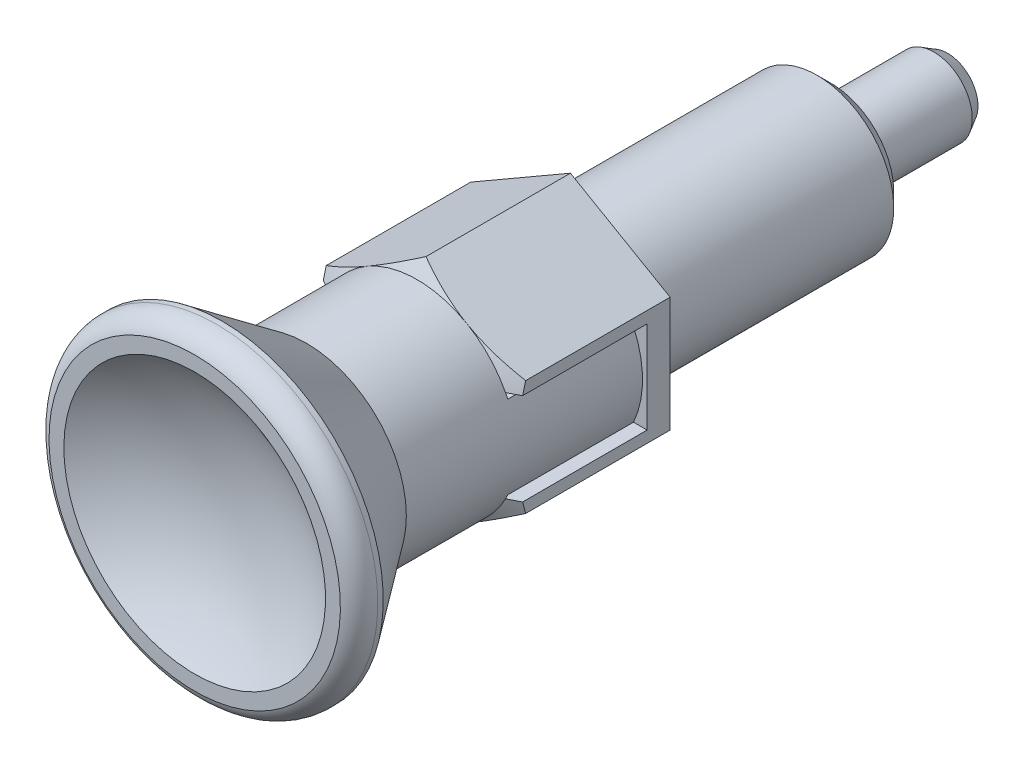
ISO-10303-21;
HEADER;
FILE_DESCRIPTION(('STEP AP214'),'2;1');
FILE_NAME('part.step','',(''),(''),'','','');
FILE_SCHEMA(('AUTOMOTIVE_DESIGN { 1 0 10303 214 1 1 1 1 }'));
ENDSEC;
DATA;
#1=APPLICATION_CONTEXT('core data for automotive mechanical design processes');
#2=APPLICATION_PROTOCOL_DEFINITION('international standard','automotive_design',2000,#1);
#3=PRODUCT_CONTEXT('',#1,'mechanical');
#4=PRODUCT('Part','Part','',(#3));
#5=PRODUCT_RELATED_PRODUCT_CATEGORY('part','',(#4));
#6=PRODUCT_DEFINITION_FORMATION('','',#4);
#7=PRODUCT_DEFINITION_CONTEXT('part definition',#1,'design');
#8=PRODUCT_DEFINITION('design','',#6,#7);
#9=PRODUCT_DEFINITION_SHAPE('','',#8);
#10=(LENGTH_UNIT() NAMED_UNIT(*) SI_UNIT(.MILLI.,.METRE.));
#11=(NAMED_UNIT(*) PLANE_ANGLE_UNIT() SI_UNIT($,.RADIAN.));
#12=(NAMED_UNIT(*) SI_UNIT($,.STERADIAN.) SOLID_ANGLE_UNIT());
#13=UNCERTAINTY_MEASURE_WITH_UNIT(LENGTH_MEASURE(1.E-05),#10,'distance_accuracy_value','');
#14=(GEOMETRIC_REPRESENTATION_CONTEXT(3) GLOBAL_UNCERTAINTY_ASSIGNED_CONTEXT((#13)) GLOBAL_UNIT_ASSIGNED_CONTEXT((#10,
#11,#12)) REPRESENTATION_CONTEXT('',''));
#15=CARTESIAN_POINT('',(0.,0.,0.));
#16=DIRECTION('',(0.,0.,1.));
#17=DIRECTION('',(1.,0.,0.));
#18=AXIS2_PLACEMENT_3D('',#15,#16,#17);
#19=CARTESIAN_POINT('',(0.,0.,35.6));
#20=DIRECTION('',(-1.,0.,0.));
#21=DIRECTION('',(0.,1.,0.));
#22=AXIS2_PLACEMENT_3D('',#19,#20,#21);
#23=SPHERICAL_SURFACE('',#22,14.);
#24=CARTESIAN_POINT('',(0.,8.53170557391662,24.5));
#25=CARTESIAN_POINT('',(-0.239701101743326,8.5317072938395,24.5));
#26=CARTESIAN_POINT('',(-0.47937397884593,8.52159969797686,24.5));
#27=CARTESIAN_POINT('',(-0.957096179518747,8.48123987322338,24.5));
#28=CARTESIAN_POINT('',(-1.19514505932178,8.45098234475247,24.5));
#29=CARTESIAN_POINT('',(-1.66809840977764,8.37048717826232,24.5));
#30=CARTESIAN_POINT('',(-1.90299924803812,8.3202282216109,24.5));
#31=CARTESIAN_POINT('',(-2.36773233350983,8.20008811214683,24.5));
#32=CARTESIAN_POINT('',(-2.59756451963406,8.13020672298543,24.5));
#33=CARTESIAN_POINT('',(-3.05040854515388,7.97135842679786,24.5));
#34=CARTESIAN_POINT('',(-3.27342368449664,7.88240092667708,24.5));
#35=CARTESIAN_POINT('',(-3.71116976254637,7.68601114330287,24.5));
#36=CARTESIAN_POINT('',(-3.92590057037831,7.57857856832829,24.5));
#37=CARTESIAN_POINT('',(-4.34545679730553,7.34605366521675,24.5));
#38=CARTESIAN_POINT('',(-4.55028643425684,7.22096894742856,24.5));
#39=CARTESIAN_POINT('',(-4.94875279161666,6.95394741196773,24.5));
#40=CARTESIAN_POINT('',(-5.14238561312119,6.81200477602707,24.5));
#41=CARTESIAN_POINT('',(-5.51699044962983,6.51232267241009,24.5));
#42=CARTESIAN_POINT('',(-5.69796342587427,6.35458440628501,24.5));
#43=CARTESIAN_POINT('',(-6.04598097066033,6.0244208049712,24.5));
#44=CARTESIAN_POINT('',(-6.21302532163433,5.85199524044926,24.5));
#45=CARTESIAN_POINT('',(-6.53199815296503,5.49368132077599,24.5));
#46=CARTESIAN_POINT('',(-6.6839263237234,5.30779269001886,24.5));
#47=CARTESIAN_POINT('',(-6.97158596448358,4.92387306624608,24.5));
#48=CARTESIAN_POINT('',(-7.10731707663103,4.72584180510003,24.5));
#49=CARTESIAN_POINT('',(-7.36158785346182,4.31908993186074,24.5));
#50=CARTESIAN_POINT('',(-7.48013099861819,4.11037149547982,24.5));
#51=CARTESIAN_POINT('',(-7.69925411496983,3.68361770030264,24.5));
#52=CARTESIAN_POINT('',(-7.79982785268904,3.46557914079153,24.5));
#53=CARTESIAN_POINT('',(-7.98222972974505,3.02184395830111,24.5));
#54=CARTESIAN_POINT('',(-8.06406129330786,2.79614874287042,24.5));
#55=CARTESIAN_POINT('',(-8.20842175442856,2.33866337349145,24.5));
#56=CARTESIAN_POINT('',(-8.27095035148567,2.1068731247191,24.5));
#57=CARTESIAN_POINT('',(-8.37625770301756,1.63885297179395,24.5));
#58=CARTESIAN_POINT('',(-8.41903679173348,1.40262314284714,24.5));
#59=CARTESIAN_POINT('',(-8.48454328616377,0.927394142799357,24.5));
#60=CARTESIAN_POINT('',(-8.50727024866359,0.688394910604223,24.5));
#61=CARTESIAN_POINT('',(-8.53250695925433,0.209376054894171,24.5));
#62=CARTESIAN_POINT('',(-8.53502046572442,-0.030643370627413,24.5));
#63=CARTESIAN_POINT('',(-8.5198196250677,-0.510124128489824,24.5));
#64=CARTESIAN_POINT('',(-8.50209827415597,-0.749585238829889,24.5));
#65=CARTESIAN_POINT('',(-8.44654739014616,-1.22611973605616,24.5));
#66=CARTESIAN_POINT('',(-8.40872148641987,-1.46319354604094,24.5));
#67=CARTESIAN_POINT('',(-8.31323191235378,-1.93331562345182,24.5));
#68=CARTESIAN_POINT('',(-8.25556793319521,-2.16636382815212,24.5));
#69=CARTESIAN_POINT('',(-8.12081350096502,-2.62676991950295,24.5));
#70=CARTESIAN_POINT('',(-8.04372339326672,-2.85412790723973,24.5));
#71=CARTESIAN_POINT('',(-7.87066231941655,-3.30154649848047,24.5));
#72=CARTESIAN_POINT('',(-7.77469093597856,-3.52160694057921,24.5));
#73=CARTESIAN_POINT('',(-7.56457013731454,-3.95282077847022,24.5));
#74=CARTESIAN_POINT('',(-7.45042407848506,-4.16397580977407,24.5));
#75=CARTESIAN_POINT('',(-7.204709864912,-4.57599267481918,24.5));
#76=CARTESIAN_POINT('',(-7.07313569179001,-4.77685091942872,24.5));
#77=CARTESIAN_POINT('',(-6.79355690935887,-5.16673175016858,24.5));
#78=CARTESIAN_POINT('',(-6.64555528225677,-5.35575647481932,24.5));
#79=CARTESIAN_POINT('',(-6.33415193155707,-5.72066897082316,24.5));
#80=CARTESIAN_POINT('',(-6.17074996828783,-5.89655653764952,24.5));
#81=CARTESIAN_POINT('',(-5.82971281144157,-6.23393780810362,24.5));
#82=CARTESIAN_POINT('',(-5.65207788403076,-6.3954317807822,24.5));
#83=CARTESIAN_POINT('',(-5.28383088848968,-6.70288487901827,24.5));
#84=CARTESIAN_POINT('',(-5.0932185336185,-6.84884366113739,24.5));
#85=CARTESIAN_POINT('',(-4.7004116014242,-7.1241591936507,24.5));
#86=CARTESIAN_POINT('',(-4.49821916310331,-7.25351899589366,24.5));
#87=CARTESIAN_POINT('',(-4.08358517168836,-7.49479054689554,24.5));
#88=CARTESIAN_POINT('',(-3.87114009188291,-7.60669623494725,24.5));
#89=CARTESIAN_POINT('',(-3.43761429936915,-7.81219183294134,24.5));
#90=CARTESIAN_POINT('',(-3.21653509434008,-7.90578492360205,24.5));
#91=CARTESIAN_POINT('',(-2.76727776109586,-8.07401431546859,24.5));
#92=CARTESIAN_POINT('',(-2.53909962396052,-8.14865059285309,24.5));
#93=CARTESIAN_POINT('',(-2.0772702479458,-8.27843463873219,24.5));
#94=CARTESIAN_POINT('',(-1.84361908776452,-8.33358268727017,24.5));
#95=CARTESIAN_POINT('',(-1.37249510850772,-8.42400095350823,24.5));
#96=CARTESIAN_POINT('',(-1.13502218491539,-8.45927062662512,24.5));
#97=CARTESIAN_POINT('',(-0.657949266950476,-8.50967905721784,24.5));
#98=CARTESIAN_POINT('',(-0.418349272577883,-8.52481781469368,24.5));
#99=CARTESIAN_POINT('',(0.0612677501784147,-8.53485664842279,24.5));
#100=CARTESIAN_POINT('',(0.301284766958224,-8.52975727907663,24.5));
#101=CARTESIAN_POINT('',(0.780039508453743,-8.49935713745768,24.5));
#102=CARTESIAN_POINT('',(1.01877721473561,-8.47405607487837,24.5));
#103=CARTESIAN_POINT('',(1.49327224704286,-8.40343211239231,24.5));
#104=CARTESIAN_POINT('',(1.72902957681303,-8.3581092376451,24.5));
#105=CARTESIAN_POINT('',(2.19592874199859,-8.24775425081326,24.5));
#106=CARTESIAN_POINT('',(2.42706976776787,-8.18271871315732,24.5));
#107=CARTESIAN_POINT('',(2.8829711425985,-8.0334295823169,24.5));
#108=CARTESIAN_POINT('',(3.10773367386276,-7.94918265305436,24.5));
#109=CARTESIAN_POINT('',(3.54940485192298,-7.76203966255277,24.5));
#110=CARTESIAN_POINT('',(3.76631204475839,-7.65914016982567,24.5));
#111=CARTESIAN_POINT('',(4.19068207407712,-7.43543649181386,24.5));
#112=CARTESIAN_POINT('',(4.39814511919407,-7.31463270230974,24.5));
#113=CARTESIAN_POINT('',(4.80216087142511,-7.05597513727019,24.5));
#114=CARTESIAN_POINT('',(4.99871337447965,-6.91812104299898,24.5));
#115=CARTESIAN_POINT('',(5.37950346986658,-6.62634702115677,24.5));
#116=CARTESIAN_POINT('',(5.56374125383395,-6.47242734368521,24.5));
#117=CARTESIAN_POINT('',(5.91862768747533,-6.14958531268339,24.5));
#118=CARTESIAN_POINT('',(6.08927386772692,-5.98066024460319,24.5));
#119=CARTESIAN_POINT('',(6.41566976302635,-5.62909362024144,24.5));
#120=CARTESIAN_POINT('',(6.57142461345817,-5.44645683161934,24.5));
#121=CARTESIAN_POINT('',(6.86702506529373,-5.068678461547,24.5));
#122=CARTESIAN_POINT('',(7.00686772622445,-4.87353457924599,24.5));
#123=CARTESIAN_POINT('',(7.26961345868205,-4.47216416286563,24.5));
#124=CARTESIAN_POINT('',(7.39251690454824,-4.26593787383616,24.5));
#125=CARTESIAN_POINT('',(7.62051616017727,-3.84386102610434,24.5));
#126=CARTESIAN_POINT('',(7.72561165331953,-3.62801029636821,24.5));
#127=CARTESIAN_POINT('',(7.91724365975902,-3.18822603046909,24.5));
#128=CARTESIAN_POINT('',(8.00378046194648,-2.96429262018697,24.5));
#129=CARTESIAN_POINT('',(8.15769585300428,-2.50989072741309,24.5));
#130=CARTESIAN_POINT('',(8.22507098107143,-2.27942107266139,24.5));
#131=CARTESIAN_POINT('',(8.34014309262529,-1.8137052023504,24.5));
#132=CARTESIAN_POINT('',(8.38784687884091,-1.57846066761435,24.5));
#133=CARTESIAN_POINT('',(8.46327786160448,-1.10474543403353,24.5));
#134=CARTESIAN_POINT('',(8.49100134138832,-0.866274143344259,24.5));
#135=CARTESIAN_POINT('',(8.52625974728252,-0.387849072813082,24.5));
#136=CARTESIAN_POINT('',(8.53379511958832,-0.147895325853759,24.5));
#137=CARTESIAN_POINT('',(8.52862498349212,0.331798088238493,24.5));
#138=CARTESIAN_POINT('',(8.51591913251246,0.571537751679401,24.5));
#139=CARTESIAN_POINT('',(8.47035660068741,1.04909074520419,24.5));
#140=CARTESIAN_POINT('',(8.43750023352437,1.28690410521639,24.5));
#141=CARTESIAN_POINT('',(8.35186267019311,1.75896084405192,24.5));
#142=CARTESIAN_POINT('',(8.29907783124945,1.99320356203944,24.5));
#143=CARTESIAN_POINT('',(8.17398097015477,2.45632829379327,24.5));
#144=CARTESIAN_POINT('',(8.10167571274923,2.68521213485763,24.5));
#145=CARTESIAN_POINT('',(7.93802712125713,3.1361221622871,24.5));
#146=CARTESIAN_POINT('',(7.84667992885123,3.35814694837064,24.5));
#147=CARTESIAN_POINT('',(7.64560805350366,3.79370687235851,24.5));
#148=CARTESIAN_POINT('',(7.53588377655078,4.00724219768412,24.5));
#149=CARTESIAN_POINT('',(7.29883882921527,4.42430601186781,24.5));
#150=CARTESIAN_POINT('',(7.17151851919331,4.62783470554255,24.5));
#151=CARTESIAN_POINT('',(6.90018708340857,5.02343989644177,24.5));
#152=CARTESIAN_POINT('',(6.75617621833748,5.21551657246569,24.5));
#153=CARTESIAN_POINT('',(6.45247425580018,5.58686986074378,24.5));
#154=CARTESIAN_POINT('',(6.29278196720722,5.76614549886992,24.5));
#155=CARTESIAN_POINT('',(5.95891965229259,6.11054627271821,24.5));
#156=CARTESIAN_POINT('',(5.78475465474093,6.2756762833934,24.5));
#157=CARTESIAN_POINT('',(5.42305871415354,6.59074977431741,24.5));
#158=CARTESIAN_POINT('',(5.23552205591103,6.74068669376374,24.5));
#159=CARTESIAN_POINT('',(4.84848604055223,7.02422451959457,24.5));
#160=CARTESIAN_POINT('',(4.64898687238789,7.15782568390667,24.5));
#161=CARTESIAN_POINT('',(4.23934049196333,7.4078063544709,24.5));
#162=CARTESIAN_POINT('',(4.02918808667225,7.5241773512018,24.5));
#163=CARTESIAN_POINT('',(3.59982553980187,7.73878930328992,24.5));
#164=CARTESIAN_POINT('',(3.38061550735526,7.83703047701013,24.5));
#165=CARTESIAN_POINT('',(2.93492880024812,8.01459089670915,24.5));
#166=CARTESIAN_POINT('',(2.7084601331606,8.09393023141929,24.5));
#167=CARTESIAN_POINT('',(2.24972197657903,8.23323823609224,24.5));
#168=CARTESIAN_POINT('',(2.01745402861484,8.29321199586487,24.5));
#169=CARTESIAN_POINT('',(1.49030380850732,8.40586518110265,24.5));
#170=CARTESIAN_POINT('',(1.1942237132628,8.45301528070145,24.5));
#171=CARTESIAN_POINT('',(0.598747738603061,8.51593440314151,24.5));
#172=CARTESIAN_POINT('',(0.29935185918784,8.53170342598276,24.5));
#173=CARTESIAN_POINT('',(0.,8.53170557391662,24.5));
#174=B_SPLINE_CURVE_WITH_KNOTS('',3,(#24,#25,#26,#27,#28,#29,#30,#31,#32,#33,#34,#35,#36,#37,
#38,#39,#40,#41,#42,#43,#44,#45,#46,#47,#48,#49,#50,#51,#52,#53,#54,#55,#56,#57,#58,#59,#60,#61,
#62,#63,#64,#65,#66,#67,#68,#69,#70,#71,#72,#73,#74,#75,#76,#77,#78,#79,#80,#81,#82,#83,#84,#85,
#86,#87,#88,#89,#90,#91,#92,#93,#94,#95,#96,#97,#98,#99,#100,#101,#102,#103,#104,#105,#106,#107,
#108,#109,#110,#111,#112,#113,#114,#115,#116,#117,#118,#119,#120,#121,#122,#123,#124,#125,#126,
#127,#128,#129,#130,#131,#132,#133,#134,#135,#136,#137,#138,#139,#140,#141,#142,#143,#144,#145,
#146,#147,#148,#149,#150,#151,#152,#153,#154,#155,#156,#157,#158,#159,#160,#161,#162,#163,#164,
#165,#166,#167,#168,#169,#170,#171,#172,#173),.UNSPECIFIED.,.T.,.F.,(4,2,2,2,2,2,2,2,2,2,2,2,2,
2,2,2,2,2,2,2,2,2,2,2,2,2,2,2,2,2,2,2,2,2,2,2,2,2,2,2,2,2,2,2,2,2,2,2,2,2,2,2,2,2,2,2,2,2,2,2,2,
2,2,2,2,2,2,2,2,2,2,2,2,2,4),(0.,0.718841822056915,1.43787277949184,2.15767218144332,
2.87748025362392,3.59693418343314,4.31639947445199,5.03555552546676,5.75496050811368,
6.47431080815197,7.19367234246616,7.9130486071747,8.63244076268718,9.35168704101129,
10.0711823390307,10.790546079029,11.5099210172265,12.2292837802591,12.9486624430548,
13.6679073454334,14.387401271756,15.1067653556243,15.8261406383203,16.5455031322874,
17.2648815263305,17.9841272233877,18.7036219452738,19.422986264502,20.1423617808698,
20.8617238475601,21.5811018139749,22.3003473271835,23.0198420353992,23.7392116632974,
24.4585821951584,25.1779423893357,25.8973222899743,26.616702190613,27.3360623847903,
28.0554329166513,28.7748025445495,29.4942972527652,30.2135427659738,30.9329207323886,
31.6522827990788,32.3716583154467,33.0910226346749,33.8105173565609,34.5297630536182,
35.2491414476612,35.9685039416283,36.6878792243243,37.4072433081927,38.1267372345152,
38.8459821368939,39.5653607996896,40.2847235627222,41.0040985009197,41.7234622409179,
42.4429575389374,43.1622038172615,43.881595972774,44.6009722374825,45.3203337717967,
46.039684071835,46.7590890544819,47.4782451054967,48.1977103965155,48.9171643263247,
49.6369723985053,50.3567718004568,51.0758027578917,51.7946445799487,52.6923736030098,
53.5901026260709),.UNSPECIFIED.);
#175=CARTESIAN_POINT('',(0.,8.53170557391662,24.5));
#176=VERTEX_POINT('',#175);
#177=EDGE_CURVE('E416',#176,#176,#174,.T.);
#178=ORIENTED_EDGE('',*,*,#177,.T.);
#179=EDGE_LOOP('',(#178));
#180=FACE_BOUND('',#179,.T.);
#181=ADVANCED_FACE('F14',(#180),#23,.F.);
#182=CARTESIAN_POINT('',(8.53170557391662,0.,24.5));
#183=DIRECTION('',(0.,0.,-1.));
#184=DIRECTION('',(0.,1.,0.));
#185=AXIS2_PLACEMENT_3D('',#182,#183,#184);
#186=PLANE('',#185);
#187=ORIENTED_EDGE('',*,*,#177,.F.);
#188=EDGE_LOOP('',(#187));
#189=FACE_BOUND('',#188,.T.);
#190=CARTESIAN_POINT('',(0.,0.,24.5));
#191=DIRECTION('',(0.,0.,-1.));
#192=DIRECTION('',(0.,1.,0.));
#193=AXIS2_PLACEMENT_3D('',#190,#191,#192);
#194=CIRCLE('',#193,9.50000000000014);
#195=CARTESIAN_POINT('',(0.,9.50000000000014,24.5));
#196=VERTEX_POINT('',#195);
#197=EDGE_CURVE('E423',#196,#196,#194,.T.);
#198=ORIENTED_EDGE('',*,*,#197,.F.);
#199=EDGE_LOOP('',(#198));
#200=FACE_BOUND('',#199,.T.);
#201=ADVANCED_FACE('F406',(#189,#200),#186,.F.);
#202=CARTESIAN_POINT('',(0.,0.,-17.));
#203=DIRECTION('',(0.,0.,1.));
#204=DIRECTION('',(0.,-1.,0.));
#205=AXIS2_PLACEMENT_3D('',#202,#203,#204);
#206=CYLINDRICAL_SURFACE('',#205,5.);
#207=CARTESIAN_POINT('',(0.,0.,0.));
#208=DIRECTION('',(0.,0.,1.));
#209=DIRECTION('',(0.,-1.,0.));
#210=AXIS2_PLACEMENT_3D('',#207,#208,#209);
#211=CIRCLE('',#210,5.);
#212=CARTESIAN_POINT('',(0.,-5.,0.));
#213=VERTEX_POINT('',#212);
#214=EDGE_CURVE('E367',#213,#213,#211,.T.);
#215=ORIENTED_EDGE('',*,*,#214,.F.);
#216=EDGE_LOOP('',(#215));
#217=FACE_BOUND('',#216,.T.);
#218=CARTESIAN_POINT('',(0.,0.,-16.08));
#219=DIRECTION('',(0.,0.,1.));
#220=DIRECTION('',(0.,-1.,0.));
#221=AXIS2_PLACEMENT_3D('',#218,#219,#220);
#222=CIRCLE('',#221,5.);
#223=CARTESIAN_POINT('',(0.,-5.,-16.08));
#224=VERTEX_POINT('',#223);
#225=EDGE_CURVE('E424',#224,#224,#222,.T.);
#226=ORIENTED_EDGE('',*,*,#225,.T.);
#227=EDGE_LOOP('',(#226));
#228=FACE_BOUND('',#227,.T.);
#229=ADVANCED_FACE('F400',(#217,#228),#206,.T.);
#230=CARTESIAN_POINT('',(0.,0.,23.0857085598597));
#231=DIRECTION('',(0.,0.,-1.));
#232=DIRECTION('',(0.,1.,0.));
#233=AXIS2_PLACEMENT_3D('',#230,#231,#232);
#234=TOROIDAL_SURFACE('',#233,9.0002203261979,1.5);
#235=CARTESIAN_POINT('',(0.,0.,23.06));
#236=DIRECTION('',(0.,0.,1.));
#237=DIRECTION('',(0.,-1.,0.));
#238=AXIS2_PLACEMENT_3D('',#235,#236,#237);
#239=CIRCLE('',#238,10.5);
#240=CARTESIAN_POINT('',(0.,-10.5,23.06));
#241=VERTEX_POINT('',#240);
#242=EDGE_CURVE('E335',#241,#241,#239,.F.);
#243=ORIENTED_EDGE('',*,*,#242,.F.);
#244=EDGE_LOOP('',(#243));
#245=FACE_BOUND('',#244,.T.);
#246=ORIENTED_EDGE('',*,*,#197,.T.);
#247=EDGE_LOOP('',(#246));
#248=FACE_BOUND('',#247,.T.);
#249=ADVANCED_FACE('F395',(#245,#248),#234,.T.);
#250=CARTESIAN_POINT('',(5.7662812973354,-3.,1.5));
#251=DIRECTION('',(0.,-1.,0.));
#252=DIRECTION('',(1.,0.,0.));
#253=AXIS2_PLACEMENT_3D('',#250,#251,#252);
#254=PLANE('',#253);
#255=DIRECTION('',(1.,0.,0.));
#256=VECTOR('',#255,1.);
#257=CARTESIAN_POINT('',(0.,-3.,1.5));
#258=LINE('',#257,#256);
#259=CARTESIAN_POINT('',(3.6,-3.,1.5));
#260=VERTEX_POINT('',#259);
#261=CARTESIAN_POINT('',(6.5,-3.,1.5));
#262=VERTEX_POINT('',#261);
#263=EDGE_CURVE('E134',#260,#262,#258,.T.);
#264=ORIENTED_EDGE('',*,*,#263,.F.);
#265=DIRECTION('',(0.,0.,1.));
#266=VECTOR('',#265,1.);
#267=CARTESIAN_POINT('',(3.6,-3.,10.));
#268=LINE('',#267,#266);
#269=CARTESIAN_POINT('',(3.6,-3.,10.));
#270=VERTEX_POINT('',#269);
#271=EDGE_CURVE('E308',#270,#260,#268,.F.);
#272=ORIENTED_EDGE('',*,*,#271,.F.);
#273=DIRECTION('',(1.,0.,0.));
#274=VECTOR('',#273,1.);
#275=CARTESIAN_POINT('',(8.5,-3.,10.));
#276=LINE('',#275,#274);
#277=CARTESIAN_POINT('',(5.76628129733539,-3.,10.));
#278=VERTEX_POINT('',#277);
#279=EDGE_CURVE('E309',#278,#270,#276,.F.);
#280=ORIENTED_EDGE('',*,*,#279,.F.);
#281=CARTESIAN_POINT('',(6.5,-3.,9.61957782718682));
#282=CARTESIAN_POINT('',(6.3780135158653,-3.,9.68355998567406));
#283=CARTESIAN_POINT('',(6.25587706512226,-3.,9.74725290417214));
#284=CARTESIAN_POINT('',(6.011304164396,-3.,9.8740602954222));
#285=CARTESIAN_POINT('',(5.88886771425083,-3.,9.93717476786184));
#286=CARTESIAN_POINT('',(5.76628129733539,-3.,10.));
#287=B_SPLINE_CURVE_WITH_KNOTS('',3,(#281,#282,#283,#284,#285,#286),.UNSPECIFIED.,.F.,.F.,(4,2,
4),(0.,0.41323952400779,0.826479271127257),.UNSPECIFIED.);
#288=CARTESIAN_POINT('',(6.5,-3.,9.61957782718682));
#289=VERTEX_POINT('',#288);
#290=EDGE_CURVE('E127',#289,#278,#287,.T.);
#291=ORIENTED_EDGE('',*,*,#290,.F.);
#292=DIRECTION('',(0.,0.,1.));
#293=VECTOR('',#292,1.);
#294=CARTESIAN_POINT('',(6.5,-3.,0.));
#295=LINE('',#294,#293);
#296=EDGE_CURVE('E369',#262,#289,#295,.T.);
#297=ORIENTED_EDGE('',*,*,#296,.F.);
#298=EDGE_LOOP('',(#264,#272,#280,#291,#297));
#299=FACE_BOUND('',#298,.T.);
#300=ADVANCED_FACE('F399',(#299),#254,.F.);
#301=CARTESIAN_POINT('',(0.,0.,1.5));
#302=DIRECTION('',(0.,0.,1.));
#303=DIRECTION('',(0.,-1.,0.));
#304=AXIS2_PLACEMENT_3D('',#301,#302,#303);
#305=PLANE('',#304);
#306=ORIENTED_EDGE('',*,*,#263,.T.);
#307=DIRECTION('',(0.,1.,0.));
#308=VECTOR('',#307,1.);
#309=CARTESIAN_POINT('',(6.5,-3.75277674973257,1.5));
#310=LINE('',#309,#308);
#311=CARTESIAN_POINT('',(6.5,3.,1.5));
#312=VERTEX_POINT('',#311);
#313=EDGE_CURVE('E372',#312,#262,#310,.F.);
#314=ORIENTED_EDGE('',*,*,#313,.F.);
#315=DIRECTION('',(-1.,0.,0.));
#316=VECTOR('',#315,1.);
#317=CARTESIAN_POINT('',(11.,3.,1.5));
#318=LINE('',#317,#316);
#319=CARTESIAN_POINT('',(3.6,3.,1.5));
#320=VERTEX_POINT('',#319);
#321=EDGE_CURVE('E380',#312,#320,#318,.T.);
#322=ORIENTED_EDGE('',*,*,#321,.T.);
#323=DIRECTION('',(0.,1.,0.));
#324=VECTOR('',#323,1.);
#325=CARTESIAN_POINT('',(3.6,0.,1.5));
#326=LINE('',#325,#324);
#327=EDGE_CURVE('E379',#260,#320,#326,.T.);
#328=ORIENTED_EDGE('',*,*,#327,.F.);
#329=EDGE_LOOP('',(#306,#314,#322,#328));
#330=FACE_BOUND('',#329,.T.);
#331=ADVANCED_FACE('F534',(#330),#305,.T.);
#332=CARTESIAN_POINT('',(11.,3.,1.5));
#333=DIRECTION('',(0.,1.,0.));
#334=DIRECTION('',(-1.,0.,0.));
#335=AXIS2_PLACEMENT_3D('',#332,#333,#334);
#336=PLANE('',#335);
#337=CARTESIAN_POINT('',(5.76628129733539,3.,10.));
#338=CARTESIAN_POINT('',(5.88886771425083,3.,9.93717476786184));
#339=CARTESIAN_POINT('',(6.011304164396,3.,9.8740602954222));
#340=CARTESIAN_POINT('',(6.25587706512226,3.,9.74725290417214));
#341=CARTESIAN_POINT('',(6.3780135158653,3.,9.68355998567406));
#342=CARTESIAN_POINT('',(6.5,3.,9.61957782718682));
#343=B_SPLINE_CURVE_WITH_KNOTS('',3,(#337,#338,#339,#340,#341,#342),.UNSPECIFIED.,.F.,.F.,(4,2,
4),(0.,0.413239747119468,0.826479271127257),.UNSPECIFIED.);
#344=CARTESIAN_POINT('',(5.76628129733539,3.,10.));
#345=VERTEX_POINT('',#344);
#346=CARTESIAN_POINT('',(6.5,3.,9.61957782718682));
#347=VERTEX_POINT('',#346);
#348=EDGE_CURVE('E382',#345,#347,#343,.T.);
#349=ORIENTED_EDGE('',*,*,#348,.F.);
#350=DIRECTION('',(1.,0.,0.));
#351=VECTOR('',#350,1.);
#352=CARTESIAN_POINT('',(8.5,3.,10.));
#353=LINE('',#352,#351);
#354=CARTESIAN_POINT('',(3.6,3.,10.));
#355=VERTEX_POINT('',#354);
#356=EDGE_CURVE('E288',#355,#345,#353,.T.);
#357=ORIENTED_EDGE('',*,*,#356,.F.);
#358=DIRECTION('',(0.,0.,1.));
#359=VECTOR('',#358,1.);
#360=CARTESIAN_POINT('',(3.6,3.,10.));
#361=LINE('',#360,#359);
#362=EDGE_CURVE('E377',#320,#355,#361,.T.);
#363=ORIENTED_EDGE('',*,*,#362,.F.);
#364=ORIENTED_EDGE('',*,*,#321,.F.);
#365=DIRECTION('',(0.,0.,1.));
#366=VECTOR('',#365,1.);
#367=CARTESIAN_POINT('',(6.5,3.,0.));
#368=LINE('',#367,#366);
#369=EDGE_CURVE('E373',#347,#312,#368,.F.);
#370=ORIENTED_EDGE('',*,*,#369,.F.);
#371=EDGE_LOOP('',(#349,#357,#363,#364,#370));
#372=FACE_BOUND('',#371,.T.);
#373=ADVANCED_FACE('F530',(#372),#336,.F.);
#374=CARTESIAN_POINT('',(6.5,-3.75277674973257,0.));
#375=DIRECTION('',(1.,0.,0.));
#376=DIRECTION('',(0.,1.,0.));
#377=AXIS2_PLACEMENT_3D('',#374,#375,#376);
#378=PLANE('',#377);
#379=ORIENTED_EDGE('',*,*,#296,.T.);
#380=CARTESIAN_POINT('',(6.5,-3.,9.61957782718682));
#381=CARTESIAN_POINT('',(6.5,-3.06309951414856,9.60431125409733));
#382=CARTESIAN_POINT('',(6.5,-3.1261079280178,9.58866977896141));
#383=CARTESIAN_POINT('',(6.5,-3.25193500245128,9.55667176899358));
#384=CARTESIAN_POINT('',(6.5,-3.31475368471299,9.54031531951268));
#385=CARTESIAN_POINT('',(6.5,-3.44020824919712,9.50691859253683));
#386=CARTESIAN_POINT('',(6.5,-3.50284413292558,9.48987832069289));
#387=CARTESIAN_POINT('',(6.5,-3.62794227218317,9.45514336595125));
#388=CARTESIAN_POINT('',(6.5,-3.6904045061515,9.43744860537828));
#389=CARTESIAN_POINT('',(6.5,-3.75277678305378,9.41944340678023));
#390=B_SPLINE_CURVE_WITH_KNOTS('',3,(#380,#381,#382,#383,#384,#385,#386,#387,#388,#389),
.UNSPECIFIED.,.F.,.F.,(4,2,2,2,4),(0.,0.194758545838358,0.389493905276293,0.584227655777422,
0.778984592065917),.UNSPECIFIED.);
#391=CARTESIAN_POINT('',(6.5,-3.75277676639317,9.41944341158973));
#392=VERTEX_POINT('',#391);
#393=EDGE_CURVE('E368',#289,#392,#390,.T.);
#394=ORIENTED_EDGE('',*,*,#393,.T.);
#395=DIRECTION('',(0.,0.,1.));
#396=VECTOR('',#395,1.);
#397=CARTESIAN_POINT('',(6.5,-3.75277674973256,0.));
#398=LINE('',#397,#396);
#399=CARTESIAN_POINT('',(6.5,-3.75277674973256,0.));
#400=VERTEX_POINT('',#399);
#401=EDGE_CURVE('E312',#400,#392,#398,.T.);
#402=ORIENTED_EDGE('',*,*,#401,.F.);
#403=DIRECTION('',(0.,1.,0.));
#404=VECTOR('',#403,1.);
#405=CARTESIAN_POINT('',(6.5,0.,0.));
#406=LINE('',#405,#404);
#407=CARTESIAN_POINT('',(6.5,3.75277674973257,0.));
#408=VERTEX_POINT('',#407);
#409=EDGE_CURVE('E365',#408,#400,#406,.F.);
#410=ORIENTED_EDGE('',*,*,#409,.F.);
#411=DIRECTION('',(0.,0.,1.));
#412=VECTOR('',#411,1.);
#413=CARTESIAN_POINT('',(6.5,3.75277674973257,0.));
#414=LINE('',#413,#412);
#415=CARTESIAN_POINT('',(6.5,3.75277674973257,9.41944341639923));
#416=VERTEX_POINT('',#415);
#417=EDGE_CURVE('E285',#416,#408,#414,.F.);
#418=ORIENTED_EDGE('',*,*,#417,.F.);
#419=CARTESIAN_POINT('',(6.5,3.75277674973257,9.41944341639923));
#420=CARTESIAN_POINT('',(6.5,3.6904044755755,9.43744861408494));
#421=CARTESIAN_POINT('',(6.5,3.62794224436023,9.45514337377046));
#422=CARTESIAN_POINT('',(6.5,3.50284411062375,9.4898783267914));
#423=CARTESIAN_POINT('',(6.5,3.44020822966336,9.50691859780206));
#424=CARTESIAN_POINT('',(6.5,3.31475367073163,9.54031532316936));
#425=CARTESIAN_POINT('',(6.5,3.25193499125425,9.55667177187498));
#426=CARTESIAN_POINT('',(6.5,3.12610792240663,9.58866978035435));
#427=CARTESIAN_POINT('',(6.5,3.0630995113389,9.60431125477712));
#428=CARTESIAN_POINT('',(6.5,3.,9.61957782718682));
#429=B_SPLINE_CURVE_WITH_KNOTS('',3,(#419,#420,#421,#422,#423,#424,#425,#426,#427,#428),
.UNSPECIFIED.,.F.,.F.,(4,2,2,2,4),(0.,0.194756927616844,0.389490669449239,0.584226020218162,
0.778984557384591),.UNSPECIFIED.);
#430=EDGE_CURVE('E376',#416,#347,#429,.T.);
#431=ORIENTED_EDGE('',*,*,#430,.T.);
#432=ORIENTED_EDGE('',*,*,#369,.T.);
#433=ORIENTED_EDGE('',*,*,#313,.T.);
#434=EDGE_LOOP('',(#379,#394,#402,#410,#418,#431,#432,#433));
#435=FACE_BOUND('',#434,.T.);
#436=ADVANCED_FACE('F533',(#435),#378,.T.);
#437=CARTESIAN_POINT('',(5.,0.,0.));
#438=DIRECTION('',(0.,0.,-1.));
#439=DIRECTION('',(0.,1.,0.));
#440=AXIS2_PLACEMENT_3D('',#437,#438,#439);
#441=PLANE('',#440);
#442=ORIENTED_EDGE('',*,*,#214,.T.);
#443=EDGE_LOOP('',(#442));
#444=FACE_BOUND('',#443,.T.);
#445=DIRECTION('',(0.,-1.,0.));
#446=VECTOR('',#445,1.);
#447=CARTESIAN_POINT('',(-6.5,3.75277674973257,0.));
#448=LINE('',#447,#446);
#449=CARTESIAN_POINT('',(-6.5,3.75277674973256,0.));
#450=VERTEX_POINT('',#449);
#451=CARTESIAN_POINT('',(-6.5,-3.75277674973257,0.));
#452=VERTEX_POINT('',#451);
#453=EDGE_CURVE('E358',#450,#452,#448,.T.);
#454=ORIENTED_EDGE('',*,*,#453,.F.);
#455=DIRECTION('',(-0.866025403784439,-0.5,0.));
#456=VECTOR('',#455,1.);
#457=CARTESIAN_POINT('',(0.,7.50555349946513,0.));
#458=LINE('',#457,#456);
#459=CARTESIAN_POINT('',(0.,7.50555349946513,0.));
#460=VERTEX_POINT('',#459);
#461=EDGE_CURVE('E275',#460,#450,#458,.T.);
#462=ORIENTED_EDGE('',*,*,#461,.F.);
#463=DIRECTION('',(-0.866025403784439,0.5,0.));
#464=VECTOR('',#463,1.);
#465=CARTESIAN_POINT('',(6.5,3.75277674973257,0.));
#466=LINE('',#465,#464);
#467=EDGE_CURVE('E279',#408,#460,#466,.T.);
#468=ORIENTED_EDGE('',*,*,#467,.F.);
#469=ORIENTED_EDGE('',*,*,#409,.T.);
#470=DIRECTION('',(0.866025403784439,0.5,0.));
#471=VECTOR('',#470,1.);
#472=CARTESIAN_POINT('',(0.,-7.50555349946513,0.));
#473=LINE('',#472,#471);
#474=CARTESIAN_POINT('',(0.,-7.50555349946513,0.));
#475=VERTEX_POINT('',#474);
#476=EDGE_CURVE('E315',#475,#400,#473,.T.);
#477=ORIENTED_EDGE('',*,*,#476,.F.);
#478=DIRECTION('',(0.866025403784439,-0.5,0.));
#479=VECTOR('',#478,1.);
#480=CARTESIAN_POINT('',(-6.5,-3.75277674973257,0.));
#481=LINE('',#480,#479);
#482=EDGE_CURVE('E319',#452,#475,#481,.T.);
#483=ORIENTED_EDGE('',*,*,#482,.F.);
#484=EDGE_LOOP('',(#454,#462,#468,#469,#477,#483));
#485=FACE_BOUND('',#484,.T.);
#486=ADVANCED_FACE('F614',(#444,#485),#441,.T.);
#487=CARTESIAN_POINT('',(-6.5,3.75277674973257,0.));
#488=DIRECTION('',(-1.,0.,0.));
#489=DIRECTION('',(0.,-1.,0.));
#490=AXIS2_PLACEMENT_3D('',#487,#488,#489);
#491=PLANE('',#490);
#492=DIRECTION('',(0.,0.,1.));
#493=VECTOR('',#492,1.);
#494=CARTESIAN_POINT('',(-6.5,-3.75277674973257,0.));
#495=LINE('',#494,#493);
#496=CARTESIAN_POINT('',(-6.5,-3.75277674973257,9.41944341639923));
#497=VERTEX_POINT('',#496);
#498=EDGE_CURVE('E325',#497,#452,#495,.F.);
#499=ORIENTED_EDGE('',*,*,#498,.F.);
#500=CARTESIAN_POINT('',(-6.5,-3.75277674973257,9.41944341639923));
#501=CARTESIAN_POINT('',(-6.5,-3.6904044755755,9.43744861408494));
#502=CARTESIAN_POINT('',(-6.5,-3.62794224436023,9.45514337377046));
#503=CARTESIAN_POINT('',(-6.5,-3.50284411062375,9.4898783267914));
#504=CARTESIAN_POINT('',(-6.5,-3.44020822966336,9.50691859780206));
#505=CARTESIAN_POINT('',(-6.5,-3.31475367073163,9.54031532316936));
#506=CARTESIAN_POINT('',(-6.5,-3.25193499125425,9.55667177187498));
#507=CARTESIAN_POINT('',(-6.5,-3.12610792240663,9.58866978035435));
#508=CARTESIAN_POINT('',(-6.5,-3.0630995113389,9.60431125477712));
#509=CARTESIAN_POINT('',(-6.5,-3.,9.61957782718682));
#510=B_SPLINE_CURVE_WITH_KNOTS('',3,(#500,#501,#502,#503,#504,#505,#506,#507,#508,#509),
.UNSPECIFIED.,.F.,.F.,(4,2,2,2,4),(0.,0.194756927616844,0.389490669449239,0.584226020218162,
0.778984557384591),.UNSPECIFIED.);
#511=CARTESIAN_POINT('',(-6.5,-3.,9.61957782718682));
#512=VERTEX_POINT('',#511);
#513=EDGE_CURVE('E360',#497,#512,#510,.T.);
#514=ORIENTED_EDGE('',*,*,#513,.T.);
#515=DIRECTION('',(0.,0.,1.));
#516=VECTOR('',#515,1.);
#517=CARTESIAN_POINT('',(-6.5,-3.,1.5));
#518=LINE('',#517,#516);
#519=CARTESIAN_POINT('',(-6.5,-3.,1.5));
#520=VERTEX_POINT('',#519);
#521=EDGE_CURVE('E355',#512,#520,#518,.F.);
#522=ORIENTED_EDGE('',*,*,#521,.T.);
#523=DIRECTION('',(0.,-1.,0.));
#524=VECTOR('',#523,1.);
#525=CARTESIAN_POINT('',(-6.5,0.,1.5));
#526=LINE('',#525,#524);
#527=CARTESIAN_POINT('',(-6.5,3.,1.5));
#528=VERTEX_POINT('',#527);
#529=EDGE_CURVE('E354',#528,#520,#526,.T.);
#530=ORIENTED_EDGE('',*,*,#529,.F.);
#531=DIRECTION('',(0.,0.,1.));
#532=VECTOR('',#531,1.);
#533=CARTESIAN_POINT('',(-6.5,3.,1.5));
#534=LINE('',#533,#532);
#535=CARTESIAN_POINT('',(-6.5,3.,9.61957782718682));
#536=VERTEX_POINT('',#535);
#537=EDGE_CURVE('E338',#528,#536,#534,.T.);
#538=ORIENTED_EDGE('',*,*,#537,.T.);
#539=CARTESIAN_POINT('',(-6.5,3.,9.61957782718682));
#540=CARTESIAN_POINT('',(-6.5,3.06309951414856,9.60431125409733));
#541=CARTESIAN_POINT('',(-6.5,3.1261079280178,9.58866977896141));
#542=CARTESIAN_POINT('',(-6.5,3.25193500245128,9.55667176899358));
#543=CARTESIAN_POINT('',(-6.5,3.31475368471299,9.54031531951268));
#544=CARTESIAN_POINT('',(-6.5,3.44020824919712,9.50691859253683));
#545=CARTESIAN_POINT('',(-6.5,3.50284413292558,9.48987832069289));
#546=CARTESIAN_POINT('',(-6.5,3.62794227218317,9.45514336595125));
#547=CARTESIAN_POINT('',(-6.5,3.6904045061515,9.43744860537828));
#548=CARTESIAN_POINT('',(-6.5,3.75277678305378,9.41944340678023));
#549=B_SPLINE_CURVE_WITH_KNOTS('',3,(#539,#540,#541,#542,#543,#544,#545,#546,#547,#548),
.UNSPECIFIED.,.F.,.F.,(4,2,2,2,4),(0.,0.194758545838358,0.389493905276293,0.584227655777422,
0.778984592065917),.UNSPECIFIED.);
#550=CARTESIAN_POINT('',(-6.5,3.75277676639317,9.41944341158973));
#551=VERTEX_POINT('',#550);
#552=EDGE_CURVE('E361',#536,#551,#549,.T.);
#553=ORIENTED_EDGE('',*,*,#552,.T.);
#554=DIRECTION('',(0.,0.,1.));
#555=VECTOR('',#554,1.);
#556=CARTESIAN_POINT('',(-6.5,3.75277674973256,0.));
#557=LINE('',#556,#555);
#558=EDGE_CURVE('E272',#450,#551,#557,.T.);
#559=ORIENTED_EDGE('',*,*,#558,.F.);
#560=ORIENTED_EDGE('',*,*,#453,.T.);
#561=EDGE_LOOP('',(#499,#514,#522,#530,#538,#553,#559,#560));
#562=FACE_BOUND('',#561,.T.);
#563=ADVANCED_FACE('F575',(#562),#491,.T.);
#564=CARTESIAN_POINT('',(-11.,-3.,1.5));
#565=DIRECTION('',(0.,-1.,0.));
#566=DIRECTION('',(1.,0.,0.));
#567=AXIS2_PLACEMENT_3D('',#564,#565,#566);
#568=PLANE('',#567);
#569=CARTESIAN_POINT('',(-5.7662812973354,-3.,10.));
#570=CARTESIAN_POINT('',(-5.88886771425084,-3.,9.93717476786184));
#571=CARTESIAN_POINT('',(-6.011304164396,-3.00000000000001,9.87406029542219));
#572=CARTESIAN_POINT('',(-6.25587706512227,-3.00000000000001,9.74725290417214));
#573=CARTESIAN_POINT('',(-6.3780135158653,-3.,9.68355998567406));
#574=CARTESIAN_POINT('',(-6.5,-3.,9.61957782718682));
#575=B_SPLINE_CURVE_WITH_KNOTS('',3,(#569,#570,#571,#572,#573,#574),.UNSPECIFIED.,.F.,.F.,(4,2,
4),(0.,0.413239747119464,0.826479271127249),.UNSPECIFIED.);
#576=CARTESIAN_POINT('',(-5.76628129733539,-3.,10.));
#577=VERTEX_POINT('',#576);
#578=EDGE_CURVE('E357',#577,#512,#575,.T.);
#579=ORIENTED_EDGE('',*,*,#578,.F.);
#580=DIRECTION('',(1.,0.,0.));
#581=VECTOR('',#580,1.);
#582=CARTESIAN_POINT('',(-8.5,-3.,10.));
#583=LINE('',#582,#581);
#584=CARTESIAN_POINT('',(-3.6,-3.,10.));
#585=VERTEX_POINT('',#584);
#586=EDGE_CURVE('E328',#577,#585,#583,.T.);
#587=ORIENTED_EDGE('',*,*,#586,.T.);
#588=DIRECTION('',(0.,0.,1.));
#589=VECTOR('',#588,1.);
#590=CARTESIAN_POINT('',(-3.6,-3.,10.));
#591=LINE('',#590,#589);
#592=CARTESIAN_POINT('',(-3.6,-3.,1.5));
#593=VERTEX_POINT('',#592);
#594=EDGE_CURVE('E267',#585,#593,#591,.F.);
#595=ORIENTED_EDGE('',*,*,#594,.T.);
#596=DIRECTION('',(1.,0.,0.));
#597=VECTOR('',#596,1.);
#598=CARTESIAN_POINT('',(0.,-3.,1.5));
#599=LINE('',#598,#597);
#600=EDGE_CURVE('E351',#520,#593,#599,.T.);
#601=ORIENTED_EDGE('',*,*,#600,.F.);
#602=ORIENTED_EDGE('',*,*,#521,.F.);
#603=EDGE_LOOP('',(#579,#587,#595,#601,#602));
#604=FACE_BOUND('',#603,.T.);
#605=ADVANCED_FACE('F606',(#604),#568,.F.);
#606=CARTESIAN_POINT('',(0.,0.,1.5));
#607=DIRECTION('',(0.,0.,1.));
#608=DIRECTION('',(0.,-1.,0.));
#609=AXIS2_PLACEMENT_3D('',#606,#607,#608);
#610=PLANE('',#609);
#611=DIRECTION('',(-1.,0.,0.));
#612=VECTOR('',#611,1.);
#613=CARTESIAN_POINT('',(-5.7662812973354,3.,1.5));
#614=LINE('',#613,#612);
#615=CARTESIAN_POINT('',(-3.6,3.,1.5));
#616=VERTEX_POINT('',#615);
#617=EDGE_CURVE('E346',#616,#528,#614,.T.);
#618=ORIENTED_EDGE('',*,*,#617,.T.);
#619=ORIENTED_EDGE('',*,*,#529,.T.);
#620=ORIENTED_EDGE('',*,*,#600,.T.);
#621=DIRECTION('',(0.,1.,0.));
#622=VECTOR('',#621,1.);
#623=CARTESIAN_POINT('',(-3.6,0.,1.5));
#624=LINE('',#623,#622);
#625=EDGE_CURVE('E342',#593,#616,#624,.T.);
#626=ORIENTED_EDGE('',*,*,#625,.T.);
#627=EDGE_LOOP('',(#618,#619,#620,#626));
#628=FACE_BOUND('',#627,.T.);
#629=ADVANCED_FACE('F603',(#628),#610,.T.);
#630=CARTESIAN_POINT('',(-5.7662812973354,3.,1.5));
#631=DIRECTION('',(0.,1.,0.));
#632=DIRECTION('',(-1.,0.,0.));
#633=AXIS2_PLACEMENT_3D('',#630,#631,#632);
#634=PLANE('',#633);
#635=ORIENTED_EDGE('',*,*,#617,.F.);
#636=DIRECTION('',(0.,0.,1.));
#637=VECTOR('',#636,1.);
#638=CARTESIAN_POINT('',(-3.6,3.,10.));
#639=LINE('',#638,#637);
#640=CARTESIAN_POINT('',(-3.6,3.,10.));
#641=VERTEX_POINT('',#640);
#642=EDGE_CURVE('E271',#616,#641,#639,.T.);
#643=ORIENTED_EDGE('',*,*,#642,.T.);
#644=DIRECTION('',(1.,0.,0.));
#645=VECTOR('',#644,1.);
#646=CARTESIAN_POINT('',(-8.5,3.,10.));
#647=LINE('',#646,#645);
#648=CARTESIAN_POINT('',(-5.76628129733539,3.,10.));
#649=VERTEX_POINT('',#648);
#650=EDGE_CURVE('E264',#641,#649,#647,.F.);
#651=ORIENTED_EDGE('',*,*,#650,.T.);
#652=CARTESIAN_POINT('',(-6.5,3.,9.61957782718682));
#653=CARTESIAN_POINT('',(-6.3780135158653,3.,9.68355998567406));
#654=CARTESIAN_POINT('',(-6.25587706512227,3.,9.74725290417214));
#655=CARTESIAN_POINT('',(-6.011304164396,3.,9.87406029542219));
#656=CARTESIAN_POINT('',(-5.88886771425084,3.,9.93717476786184));
#657=CARTESIAN_POINT('',(-5.7662812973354,3.,10.));
#658=B_SPLINE_CURVE_WITH_KNOTS('',3,(#652,#653,#654,#655,#656,#657),.UNSPECIFIED.,.F.,.F.,(4,2,
4),(0.,0.413239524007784,0.826479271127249),.UNSPECIFIED.);
#659=EDGE_CURVE('E349',#536,#649,#658,.T.);
#660=ORIENTED_EDGE('',*,*,#659,.F.);
#661=ORIENTED_EDGE('',*,*,#537,.F.);
#662=EDGE_LOOP('',(#635,#643,#651,#660,#661));
#663=FACE_BOUND('',#662,.T.);
#664=ADVANCED_FACE('F579',(#663),#634,.F.);
#665=CARTESIAN_POINT('',(0.,0.,-25.));
#666=DIRECTION('',(0.,0.,1.));
#667=DIRECTION('',(0.,-1.,0.));
#668=AXIS2_PLACEMENT_3D('',#665,#666,#667);
#669=CYLINDRICAL_SURFACE('',#668,10.5);
#670=ORIENTED_EDGE('',*,*,#242,.T.);
#671=EDGE_LOOP('',(#670));
#672=FACE_BOUND('',#671,.T.);
#673=CARTESIAN_POINT('',(0.,0.,22.7055276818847));
#674=DIRECTION('',(0.,0.,1.));
#675=DIRECTION('',(0.,-1.,0.));
#676=AXIS2_PLACEMENT_3D('',#673,#674,#675);
#677=CIRCLE('',#676,10.5);
#678=CARTESIAN_POINT('',(0.,-10.5,22.7055276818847));
#679=VERTEX_POINT('',#678);
#680=EDGE_CURVE('E256',#679,#679,#677,.F.);
#681=ORIENTED_EDGE('',*,*,#680,.F.);
#682=EDGE_LOOP('',(#681));
#683=FACE_BOUND('',#682,.T.);
#684=ADVANCED_FACE('F602',(#672,#683),#669,.T.);
#685=CARTESIAN_POINT('',(-8.5,-2.7,10.));
#686=DIRECTION('',(0.,0.,1.));
#687=DIRECTION('',(0.,-1.,0.));
#688=AXIS2_PLACEMENT_3D('',#685,#686,#687);
#689=PLANE('',#688);
#690=DIRECTION('',(0.,1.,0.));
#691=VECTOR('',#690,1.);
#692=CARTESIAN_POINT('',(-3.6,0.,10.));
#693=LINE('',#692,#691);
#694=CARTESIAN_POINT('',(-3.6,-2.7,10.));
#695=VERTEX_POINT('',#694);
#696=EDGE_CURVE('E259',#695,#585,#693,.F.);
#697=ORIENTED_EDGE('',*,*,#696,.T.);
#698=ORIENTED_EDGE('',*,*,#586,.F.);
#699=CARTESIAN_POINT('',(0.,0.,10.));
#700=DIRECTION('',(0.,0.,1.));
#701=DIRECTION('',(0.,-1.,0.));
#702=AXIS2_PLACEMENT_3D('',#699,#700,#701);
#703=CIRCLE('',#702,6.5);
#704=CARTESIAN_POINT('',(-5.91269819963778,-2.7,10.));
#705=VERTEX_POINT('',#704);
#706=EDGE_CURVE('E334',#705,#577,#703,.T.);
#707=ORIENTED_EDGE('',*,*,#706,.F.);
#708=DIRECTION('',(1.,0.,0.));
#709=VECTOR('',#708,1.);
#710=CARTESIAN_POINT('',(-8.5,-2.7,10.));
#711=LINE('',#710,#709);
#712=EDGE_CURVE('E254',#705,#695,#711,.T.);
#713=ORIENTED_EDGE('',*,*,#712,.T.);
#714=EDGE_LOOP('',(#697,#698,#707,#713));
#715=FACE_BOUND('',#714,.T.);
#716=ADVANCED_FACE('F670',(#715),#689,.F.);
#717=CARTESIAN_POINT('',(-6.5,-3.75277674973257,0.));
#718=DIRECTION('',(-0.5,-0.866025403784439,0.));
#719=DIRECTION('',(0.866025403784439,-0.5,0.));
#720=AXIS2_PLACEMENT_3D('',#717,#718,#719);
#721=PLANE('',#720);
#722=CARTESIAN_POINT('',(-3.25,-5.62916512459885,10.));
#723=CARTESIAN_POINT('',(-3.11205573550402,-5.70880728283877,10.0000265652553));
#724=CARTESIAN_POINT('',(-2.97411811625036,-5.78844560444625,9.99662027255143));
#725=CARTESIAN_POINT('',(-2.69851372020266,-5.94756587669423,9.98313941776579));
#726=CARTESIAN_POINT('',(-2.56084689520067,-6.02704785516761,9.97306617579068));
#727=CARTESIAN_POINT('',(-2.2866733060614,-6.18534205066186,9.94651520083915));
#728=CARTESIAN_POINT('',(-2.15016418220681,-6.26415563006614,9.93006970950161));
#729=CARTESIAN_POINT('',(-1.87779631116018,-6.42140729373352,9.89112798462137));
#730=CARTESIAN_POINT('',(-1.74193758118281,-6.49984536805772,9.86863159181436));
#731=CARTESIAN_POINT('',(-1.33590012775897,-6.73427120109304,9.79276103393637));
#732=CARTESIAN_POINT('',(-1.06690095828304,-6.88957794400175,9.73096864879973));
#733=CARTESIAN_POINT('',(-0.531215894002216,-7.19885586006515,9.58845960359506));
#734=CARTESIAN_POINT('',(-0.264548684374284,-7.35281624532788,9.50764843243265));
#735=CARTESIAN_POINT('',(-7.50305356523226E-08,-7.50555345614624,9.41944344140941));
#736=B_SPLINE_CURVE_WITH_KNOTS('',3,(#722,#723,#724,#725,#726,#727,#728,#729,#730,#731,#732,
#733,#734,#735),.UNSPECIFIED.,.F.,.F.,(4,2,2,2,2,2,4),(0.,0.477804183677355,0.955513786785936,
1.43083723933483,1.90617320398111,2.85559928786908,3.80984692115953),.UNSPECIFIED.);
#737=CARTESIAN_POINT('',(-3.25,-5.62916512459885,10.));
#738=VERTEX_POINT('',#737);
#739=CARTESIAN_POINT('',(-1.44294568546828E-08,-7.50555350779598,9.41944341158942));
#740=VERTEX_POINT('',#739);
#741=EDGE_CURVE('E653',#738,#740,#736,.T.);
#742=ORIENTED_EDGE('',*,*,#741,.F.);
#743=CARTESIAN_POINT('',(-6.5,-3.75277674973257,9.41944341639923));
#744=CARTESIAN_POINT('',(-6.23545138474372,-3.90551396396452,9.50764841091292));
#745=CARTESIAN_POINT('',(-5.96878416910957,-4.05947435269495,9.58845958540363));
#746=CARTESIAN_POINT('',(-5.43309909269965,-4.36875227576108,9.73096863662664));
#747=CARTESIAN_POINT('',(-5.16409991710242,-4.52405902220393,9.79276102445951));
#748=CARTESIAN_POINT('',(-4.75806245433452,-4.75848486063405,9.86863158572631));
#749=CARTESIAN_POINT('',(-4.6222037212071,-4.83692293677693,9.89112797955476));
#750=CARTESIAN_POINT('',(-4.34983584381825,-4.99417460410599,9.93006970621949));
#751=CARTESIAN_POINT('',(-4.21332671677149,-5.07298818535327,9.9465151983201));
#752=CARTESIAN_POINT('',(-3.9391531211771,-5.23128238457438,9.97306617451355));
#753=CARTESIAN_POINT('',(-3.80148629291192,-5.31076436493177,9.983139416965));
#754=CARTESIAN_POINT('',(-3.52588189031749,-5.46988464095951,9.99662027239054));
#755=CARTESIAN_POINT('',(-3.38794426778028,-5.54952296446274,10.0000265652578));
#756=CARTESIAN_POINT('',(-3.25,-5.62916512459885,10.));
#757=B_SPLINE_CURVE_WITH_KNOTS('',3,(#743,#744,#745,#746,#747,#748,#749,#750,#751,#752,#753,
#754,#755,#756),.UNSPECIFIED.,.F.,.F.,(4,2,2,2,2,2,4),(0.,0.954247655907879,1.90367376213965,
2.37900973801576,2.85433320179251,3.33204281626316,3.80984701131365),.UNSPECIFIED.);
#758=EDGE_CURVE('E263',#497,#738,#757,.T.);
#759=ORIENTED_EDGE('',*,*,#758,.F.);
#760=ORIENTED_EDGE('',*,*,#498,.T.);
#761=ORIENTED_EDGE('',*,*,#482,.T.);
#762=DIRECTION('',(0.,0.,1.));
#763=VECTOR('',#762,1.);
#764=CARTESIAN_POINT('',(0.,-7.50555349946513,0.));
#765=LINE('',#764,#763);
#766=EDGE_CURVE('E316',#740,#475,#765,.F.);
#767=ORIENTED_EDGE('',*,*,#766,.F.);
#768=EDGE_LOOP('',(#742,#759,#760,#761,#767));
#769=FACE_BOUND('',#768,.T.);
#770=ADVANCED_FACE('F666',(#769),#721,.T.);
#771=CARTESIAN_POINT('',(0.,-7.50555349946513,0.));
#772=DIRECTION('',(0.5,-0.866025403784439,0.));
#773=DIRECTION('',(0.866025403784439,0.5,0.));
#774=AXIS2_PLACEMENT_3D('',#771,#772,#773);
#775=PLANE('',#774);
#776=CARTESIAN_POINT('',(3.25,-5.62916512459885,10.));
#777=CARTESIAN_POINT('',(3.38794426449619,-5.54952296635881,10.0000265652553));
#778=CARTESIAN_POINT('',(3.52588188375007,-5.4698846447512,9.99662027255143));
#779=CARTESIAN_POINT('',(3.8014862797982,-5.31076437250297,9.98313941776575));
#780=CARTESIAN_POINT('',(3.93915310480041,-5.23128239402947,9.9730661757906));
#781=CARTESIAN_POINT('',(4.2133266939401,-5.07298819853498,9.94651520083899));
#782=CARTESIAN_POINT('',(4.3498358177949,-4.99417461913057,9.9300697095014));
#783=CARTESIAN_POINT('',(4.62220368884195,-4.83692295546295,9.89112798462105));
#784=CARTESIAN_POINT('',(4.75806241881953,-4.75848488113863,9.86863159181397));
#785=CARTESIAN_POINT('',(5.16409987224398,-4.52405904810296,9.79276103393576));
#786=CARTESIAN_POINT('',(5.43309904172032,-4.36875230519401,9.73096864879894));
#787=CARTESIAN_POINT('',(5.96878410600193,-4.05947438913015,9.58845960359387));
#788=CARTESIAN_POINT('',(6.23545131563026,-3.90551400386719,9.50764843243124));
#789=CARTESIAN_POINT('',(6.4999999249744,-3.75277679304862,9.41944344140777));
#790=B_SPLINE_CURVE_WITH_KNOTS('',3,(#776,#777,#778,#779,#780,#781,#782,#783,#784,#785,#786,
#787,#788,#789),.UNSPECIFIED.,.F.,.F.,(4,2,2,2,2,2,4),(0.,0.477804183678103,0.955513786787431,
1.43083723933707,1.90617320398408,2.85559928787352,3.80984692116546),.UNSPECIFIED.);
#791=CARTESIAN_POINT('',(3.25,-5.62916512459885,10.));
#792=VERTEX_POINT('',#791);
#793=EDGE_CURVE('E253',#792,#392,#790,.T.);
#794=ORIENTED_EDGE('',*,*,#793,.F.);
#795=CARTESIAN_POINT('',(-4.19484820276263E-08,-7.50555348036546,9.4194433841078));
#796=CARTESIAN_POINT('',(0.264548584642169,-7.35281628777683,9.50764839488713));
#797=CARTESIAN_POINT('',(0.531215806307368,-7.19885590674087,9.58845957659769));
#798=CARTESIAN_POINT('',(1.06690089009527,-6.88957798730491,9.73096863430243));
#799=CARTESIAN_POINT('',(1.33590006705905,-6.73427123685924,9.79276102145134));
#800=CARTESIAN_POINT('',(1.74193753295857,-6.49984539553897,9.86863158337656));
#801=CARTESIAN_POINT('',(1.87779626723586,-6.42140731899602,9.89112797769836));
#802=CARTESIAN_POINT('',(2.15016414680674,-6.26415565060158,9.93006970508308));
#803=CARTESIAN_POINT('',(2.28667327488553,-6.18534206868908,9.94651519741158));
#804=CARTESIAN_POINT('',(2.56084687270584,-6.02704786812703,9.97306617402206));
#805=CARTESIAN_POINT('',(2.6985137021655,-5.947565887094,9.98313941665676));
#806=CARTESIAN_POINT('',(2.97411810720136,-5.78844560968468,9.99662027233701));
#807=CARTESIAN_POINT('',(3.11205573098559,-5.70880728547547,10.0000265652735));
#808=CARTESIAN_POINT('',(3.25,-5.62916512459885,10.));
#809=B_SPLINE_CURVE_WITH_KNOTS('',3,(#795,#796,#797,#798,#799,#800,#801,#802,#803,#804,#805,
#806,#807,#808),.UNSPECIFIED.,.F.,.F.,(4,2,2,2,2,2,4),(0.,0.954247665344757,1.9036737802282,
2.37900975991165,2.85433322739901,3.33204284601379,3.80984704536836),.UNSPECIFIED.);
#810=EDGE_CURVE('E647',#740,#792,#809,.T.);
#811=ORIENTED_EDGE('',*,*,#810,.F.);
#812=ORIENTED_EDGE('',*,*,#766,.T.);
#813=ORIENTED_EDGE('',*,*,#476,.T.);
#814=ORIENTED_EDGE('',*,*,#401,.T.);
#815=EDGE_LOOP('',(#794,#811,#812,#813,#814));
#816=FACE_BOUND('',#815,.T.);
#817=ADVANCED_FACE('F669',(#816),#775,.T.);
#818=CARTESIAN_POINT('',(8.5,-2.7,10.));
#819=DIRECTION('',(0.,0.,-1.));
#820=DIRECTION('',(0.,1.,0.));
#821=AXIS2_PLACEMENT_3D('',#818,#819,#820);
#822=PLANE('',#821);
#823=DIRECTION('',(0.,1.,0.));
#824=VECTOR('',#823,1.);
#825=CARTESIAN_POINT('',(3.6,0.,10.));
#826=LINE('',#825,#824);
#827=CARTESIAN_POINT('',(3.6,-2.7,10.));
#828=VERTEX_POINT('',#827);
#829=EDGE_CURVE('E305',#828,#270,#826,.F.);
#830=ORIENTED_EDGE('',*,*,#829,.F.);
#831=DIRECTION('',(1.,0.,0.));
#832=VECTOR('',#831,1.);
#833=CARTESIAN_POINT('',(8.5,-2.7,10.));
#834=LINE('',#833,#832);
#835=CARTESIAN_POINT('',(5.91269819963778,-2.7,10.));
#836=VERTEX_POINT('',#835);
#837=EDGE_CURVE('E250',#836,#828,#834,.F.);
#838=ORIENTED_EDGE('',*,*,#837,.F.);
#839=CARTESIAN_POINT('',(0.,0.,10.));
#840=DIRECTION('',(0.,0.,1.));
#841=DIRECTION('',(0.,-1.,0.));
#842=AXIS2_PLACEMENT_3D('',#839,#840,#841);
#843=CIRCLE('',#842,6.5);
#844=EDGE_CURVE('E311',#836,#278,#843,.F.);
#845=ORIENTED_EDGE('',*,*,#844,.T.);
#846=ORIENTED_EDGE('',*,*,#279,.T.);
#847=EDGE_LOOP('',(#830,#838,#845,#846));
#848=FACE_BOUND('',#847,.T.);
#849=ADVANCED_FACE('F695',(#848),#822,.T.);
#850=CARTESIAN_POINT('',(3.6,0.,10.));
#851=DIRECTION('',(1.,0.,0.));
#852=DIRECTION('',(0.,1.,0.));
#853=AXIS2_PLACEMENT_3D('',#850,#851,#852);
#854=PLANE('',#853);
#855=DIRECTION('',(0.,1.,0.));
#856=VECTOR('',#855,1.);
#857=CARTESIAN_POINT('',(3.6,2.7,1.8));
#858=LINE('',#857,#856);
#859=CARTESIAN_POINT('',(3.6,-2.7,1.8));
#860=VERTEX_POINT('',#859);
#861=CARTESIAN_POINT('',(3.6,2.7,1.8));
#862=VERTEX_POINT('',#861);
#863=EDGE_CURVE('E235',#860,#862,#858,.T.);
#864=ORIENTED_EDGE('',*,*,#863,.F.);
#865=DIRECTION('',(0.,0.,-1.));
#866=VECTOR('',#865,1.);
#867=CARTESIAN_POINT('',(3.6,-2.7,1.8));
#868=LINE('',#867,#866);
#869=EDGE_CURVE('E236',#828,#860,#868,.T.);
#870=ORIENTED_EDGE('',*,*,#869,.F.);
#871=ORIENTED_EDGE('',*,*,#829,.T.);
#872=ORIENTED_EDGE('',*,*,#271,.T.);
#873=ORIENTED_EDGE('',*,*,#327,.T.);
#874=ORIENTED_EDGE('',*,*,#362,.T.);
#875=DIRECTION('',(0.,1.,0.));
#876=VECTOR('',#875,1.);
#877=CARTESIAN_POINT('',(3.6,3.,10.));
#878=LINE('',#877,#876);
#879=CARTESIAN_POINT('',(3.6,2.7,10.));
#880=VERTEX_POINT('',#879);
#881=EDGE_CURVE('E293',#880,#355,#878,.T.);
#882=ORIENTED_EDGE('',*,*,#881,.F.);
#883=DIRECTION('',(0.,0.,1.));
#884=VECTOR('',#883,1.);
#885=CARTESIAN_POINT('',(3.6,2.7,10.));
#886=LINE('',#885,#884);
#887=EDGE_CURVE('E249',#862,#880,#886,.T.);
#888=ORIENTED_EDGE('',*,*,#887,.F.);
#889=EDGE_LOOP('',(#864,#870,#871,#872,#873,#874,#882,#888));
#890=FACE_BOUND('',#889,.T.);
#891=ADVANCED_FACE('F704',(#890),#854,.T.);
#892=CARTESIAN_POINT('',(8.5,3.,10.));
#893=DIRECTION('',(0.,0.,-1.));
#894=DIRECTION('',(0.,1.,0.));
#895=AXIS2_PLACEMENT_3D('',#892,#893,#894);
#896=PLANE('',#895);
#897=ORIENTED_EDGE('',*,*,#881,.T.);
#898=ORIENTED_EDGE('',*,*,#356,.T.);
#899=CARTESIAN_POINT('',(0.,0.,10.));
#900=DIRECTION('',(0.,0.,1.));
#901=DIRECTION('',(0.,-1.,0.));
#902=AXIS2_PLACEMENT_3D('',#899,#900,#901);
#903=CIRCLE('',#902,6.5);
#904=CARTESIAN_POINT('',(5.91269819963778,2.7,10.));
#905=VERTEX_POINT('',#904);
#906=EDGE_CURVE('E300',#345,#905,#903,.F.);
#907=ORIENTED_EDGE('',*,*,#906,.T.);
#908=DIRECTION('',(-1.,0.,0.));
#909=VECTOR('',#908,1.);
#910=CARTESIAN_POINT('',(8.5,2.7,10.));
#911=LINE('',#910,#909);
#912=EDGE_CURVE('E294',#880,#905,#911,.F.);
#913=ORIENTED_EDGE('',*,*,#912,.F.);
#914=EDGE_LOOP('',(#897,#898,#907,#913));
#915=FACE_BOUND('',#914,.T.);
#916=ADVANCED_FACE('F478',(#915),#896,.T.);
#917=CARTESIAN_POINT('',(6.5,3.75277674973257,0.));
#918=DIRECTION('',(0.5,0.866025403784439,0.));
#919=DIRECTION('',(-0.866025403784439,0.5,0.));
#920=AXIS2_PLACEMENT_3D('',#917,#918,#919);
#921=PLANE('',#920);
#922=CARTESIAN_POINT('',(3.25,5.62916512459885,10.));
#923=CARTESIAN_POINT('',(3.1120557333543,5.70880728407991,10.0000265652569));
#924=CARTESIAN_POINT('',(2.97411811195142,5.78844560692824,9.99662027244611));
#925=CARTESIAN_POINT('',(2.69851371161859,5.94756588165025,9.98313941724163));
#926=CARTESIAN_POINT('',(2.5608468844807,6.02704786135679,9.97306617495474));
#927=CARTESIAN_POINT('',(2.28667329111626,6.18534205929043,9.94651519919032));
#928=CARTESIAN_POINT('',(2.15016416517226,6.26415563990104,9.93006970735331));
#929=CARTESIAN_POINT('',(1.87779628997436,6.42140730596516,9.89112798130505));
#930=CARTESIAN_POINT('',(1.74193755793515,6.49984538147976,9.86863158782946));
#931=CARTESIAN_POINT('',(1.33590009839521,6.73427121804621,9.79276102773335));
#932=CARTESIAN_POINT('',(1.06690092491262,6.88957796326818,9.7309686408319));
#933=CARTESIAN_POINT('',(0.531215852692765,7.19885588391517,9.58845959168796));
#934=CARTESIAN_POINT('',(0.264548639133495,7.35281627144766,9.50764841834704));
#935=CARTESIAN_POINT('',(2.59197350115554E-08,7.50555348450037,9.41944342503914));
#936=B_SPLINE_CURVE_WITH_KNOTS('',3,(#922,#923,#924,#925,#926,#927,#928,#929,#930,#931,#932,
#933,#934,#935),.UNSPECIFIED.,.F.,.F.,(4,2,2,2,2,2,4),(0.,0.477804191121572,0.955513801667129,
1.43083726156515,1.90617323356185,2.85559933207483,3.80984698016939),.UNSPECIFIED.);
#937=CARTESIAN_POINT('',(3.25,5.62916512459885,10.));
#938=VERTEX_POINT('',#937);
#939=CARTESIAN_POINT('',(-1.15429011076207E-08,7.50555349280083,9.41944342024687));
#940=VERTEX_POINT('',#939);
#941=EDGE_CURVE('E482',#938,#940,#936,.T.);
#942=ORIENTED_EDGE('',*,*,#941,.F.);
#943=CARTESIAN_POINT('',(6.5,3.75277674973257,9.41944341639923));
#944=CARTESIAN_POINT('',(6.23545138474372,3.90551396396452,9.50764841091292));
#945=CARTESIAN_POINT('',(5.96878416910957,4.05947435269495,9.58845958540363));
#946=CARTESIAN_POINT('',(5.43309909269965,4.36875227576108,9.73096863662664));
#947=CARTESIAN_POINT('',(5.16409991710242,4.52405902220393,9.79276102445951));
#948=CARTESIAN_POINT('',(4.75806245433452,4.75848486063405,9.86863158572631));
#949=CARTESIAN_POINT('',(4.6222037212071,4.83692293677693,9.89112797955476));
#950=CARTESIAN_POINT('',(4.34983584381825,4.99417460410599,9.93006970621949));
#951=CARTESIAN_POINT('',(4.21332671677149,5.07298818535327,9.9465151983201));
#952=CARTESIAN_POINT('',(3.9391531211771,5.23128238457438,9.97306617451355));
#953=CARTESIAN_POINT('',(3.80148629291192,5.31076436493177,9.983139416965));
#954=CARTESIAN_POINT('',(3.52588189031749,5.46988464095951,9.99662027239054));
#955=CARTESIAN_POINT('',(3.38794426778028,5.54952296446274,10.0000265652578));
#956=CARTESIAN_POINT('',(3.25,5.62916512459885,10.));
#957=B_SPLINE_CURVE_WITH_KNOTS('',3,(#943,#944,#945,#946,#947,#948,#949,#950,#951,#952,#953,
#954,#955,#956),.UNSPECIFIED.,.F.,.F.,(4,2,2,2,2,2,4),(0.,0.954247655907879,1.90367376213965,
2.37900973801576,2.85433320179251,3.33204281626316,3.80984701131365),.UNSPECIFIED.);
#958=EDGE_CURVE('E297',#416,#938,#957,.T.);
#959=ORIENTED_EDGE('',*,*,#958,.F.);
#960=ORIENTED_EDGE('',*,*,#417,.T.);
#961=ORIENTED_EDGE('',*,*,#467,.T.);
#962=DIRECTION('',(0.,0.,1.));
#963=VECTOR('',#962,1.);
#964=CARTESIAN_POINT('',(0.,7.50555349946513,0.));
#965=LINE('',#964,#963);
#966=EDGE_CURVE('E276',#940,#460,#965,.F.);
#967=ORIENTED_EDGE('',*,*,#966,.F.);
#968=EDGE_LOOP('',(#942,#959,#960,#961,#967));
#969=FACE_BOUND('',#968,.T.);
#970=ADVANCED_FACE('F471',(#969),#921,.T.);
#971=CARTESIAN_POINT('',(0.,7.50555349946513,0.));
#972=DIRECTION('',(-0.5,0.866025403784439,0.));
#973=DIRECTION('',(-0.866025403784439,-0.5,0.));
#974=AXIS2_PLACEMENT_3D('',#971,#972,#973);
#975=PLANE('',#974);
#976=CARTESIAN_POINT('',(-3.25,5.62916512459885,10.));
#977=CARTESIAN_POINT('',(-3.38794426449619,5.54952296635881,10.0000265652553));
#978=CARTESIAN_POINT('',(-3.52588188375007,5.4698846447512,9.99662027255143));
#979=CARTESIAN_POINT('',(-3.8014862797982,5.31076437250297,9.98313941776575));
#980=CARTESIAN_POINT('',(-3.93915310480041,5.23128239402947,9.9730661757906));
#981=CARTESIAN_POINT('',(-4.2133266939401,5.07298819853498,9.94651520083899));
#982=CARTESIAN_POINT('',(-4.3498358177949,4.99417461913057,9.9300697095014));
#983=CARTESIAN_POINT('',(-4.62220368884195,4.83692295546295,9.89112798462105));
#984=CARTESIAN_POINT('',(-4.75806241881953,4.75848488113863,9.86863159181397));
#985=CARTESIAN_POINT('',(-5.16409987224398,4.52405904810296,9.79276103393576));
#986=CARTESIAN_POINT('',(-5.43309904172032,4.36875230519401,9.73096864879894));
#987=CARTESIAN_POINT('',(-5.96878410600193,4.05947438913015,9.58845960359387));
#988=CARTESIAN_POINT('',(-6.23545131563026,3.90551400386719,9.50764843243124));
#989=CARTESIAN_POINT('',(-6.4999999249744,3.75277679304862,9.41944344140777));
#990=B_SPLINE_CURVE_WITH_KNOTS('',3,(#976,#977,#978,#979,#980,#981,#982,#983,#984,#985,#986,
#987,#988,#989),.UNSPECIFIED.,.F.,.F.,(4,2,2,2,2,2,4),(0.,0.477804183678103,0.955513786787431,
1.43083723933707,1.90617320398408,2.85559928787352,3.80984692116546),.UNSPECIFIED.);
#991=CARTESIAN_POINT('',(-3.25,5.62916512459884,10.));
#992=VERTEX_POINT('',#991);
#993=EDGE_CURVE('E213',#992,#551,#990,.T.);
#994=ORIENTED_EDGE('',*,*,#993,.F.);
#995=CARTESIAN_POINT('',(-1.65411244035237E-08,7.50555346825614,9.41944341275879));
#996=CARTESIAN_POINT('',(-0.264548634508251,7.35281626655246,9.50764841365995));
#997=CARTESIAN_POINT('',(-0.531215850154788,7.19885588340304,9.58845959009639));
#998=CARTESIAN_POINT('',(-1.06690092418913,6.88957796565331,9.73096864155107));
#999=CARTESIAN_POINT('',(-1.335900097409,6.73427121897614,9.79276102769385));
#1000=CARTESIAN_POINT('',(-1.74193755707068,6.49984538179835,9.86863158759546));
#1001=CARTESIAN_POINT('',(-1.87779628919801,6.42140730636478,9.89112798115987));
#1002=CARTESIAN_POINT('',(-2.15016416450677,6.26415564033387,9.93006970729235));
#1003=CARTESIAN_POINT('',(-2.28667329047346,6.18534205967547,9.94651519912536));
#1004=CARTESIAN_POINT('',(-2.56084688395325,6.02704786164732,9.97306617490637));
#1005=CARTESIAN_POINT('',(-2.69851371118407,5.94756588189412,9.98313941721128));
#1006=CARTESIAN_POINT('',(-2.97411811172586,5.78844560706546,9.99662027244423));
#1007=CARTESIAN_POINT('',(-3.11205573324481,5.70880728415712,10.0000265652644));
#1008=CARTESIAN_POINT('',(-3.25,5.62916512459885,10.));
#1009=B_SPLINE_CURVE_WITH_KNOTS('',3,(#995,#996,#997,#998,#999,#1000,#1001,#1002,#1003,#1004,
#1005,#1006,#1007,#1008),.UNSPECIFIED.,.F.,.F.,(4,2,2,2,2,2,4),(0.,0.954247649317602,
1.90367374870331,2.37900972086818,2.85433318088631,3.332042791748,3.80984698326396),.UNSPECIFIED.);
#1010=EDGE_CURVE('E455',#940,#992,#1009,.T.);
#1011=ORIENTED_EDGE('',*,*,#1010,.F.);
#1012=ORIENTED_EDGE('',*,*,#966,.T.);
#1013=ORIENTED_EDGE('',*,*,#461,.T.);
#1014=ORIENTED_EDGE('',*,*,#558,.T.);
#1015=EDGE_LOOP('',(#994,#1011,#1012,#1013,#1014));
#1016=FACE_BOUND('',#1015,.T.);
#1017=ADVANCED_FACE('F465',(#1016),#975,.T.);
#1018=CARTESIAN_POINT('',(-8.5,3.,10.));
#1019=DIRECTION('',(0.,0.,1.));
#1020=DIRECTION('',(0.,-1.,0.));
#1021=AXIS2_PLACEMENT_3D('',#1018,#1019,#1020);
#1022=PLANE('',#1021);
#1023=DIRECTION('',(0.,1.,0.));
#1024=VECTOR('',#1023,1.);
#1025=CARTESIAN_POINT('',(-3.6,0.,10.));
#1026=LINE('',#1025,#1024);
#1027=CARTESIAN_POINT('',(-3.6,2.7,10.));
#1028=VERTEX_POINT('',#1027);
#1029=EDGE_CURVE('E269',#641,#1028,#1026,.F.);
#1030=ORIENTED_EDGE('',*,*,#1029,.T.);
#1031=DIRECTION('',(1.,0.,0.));
#1032=VECTOR('',#1031,1.);
#1033=CARTESIAN_POINT('',(-8.5,2.7,10.));
#1034=LINE('',#1033,#1032);
#1035=CARTESIAN_POINT('',(-5.91269819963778,2.7,10.));
#1036=VERTEX_POINT('',#1035);
#1037=EDGE_CURVE('E212',#1028,#1036,#1034,.F.);
#1038=ORIENTED_EDGE('',*,*,#1037,.T.);
#1039=CARTESIAN_POINT('',(0.,0.,10.));
#1040=DIRECTION('',(0.,0.,1.));
#1041=DIRECTION('',(0.,-1.,0.));
#1042=AXIS2_PLACEMENT_3D('',#1039,#1040,#1041);
#1043=CIRCLE('',#1042,6.5);
#1044=EDGE_CURVE('E268',#649,#1036,#1043,.T.);
#1045=ORIENTED_EDGE('',*,*,#1044,.F.);
#1046=ORIENTED_EDGE('',*,*,#650,.F.);
#1047=EDGE_LOOP('',(#1030,#1038,#1045,#1046));
#1048=FACE_BOUND('',#1047,.T.);
#1049=ADVANCED_FACE('F470',(#1048),#1022,.F.);
#1050=CARTESIAN_POINT('',(-3.6,0.,10.));
#1051=DIRECTION('',(1.,0.,0.));
#1052=DIRECTION('',(0.,1.,0.));
#1053=AXIS2_PLACEMENT_3D('',#1050,#1051,#1052);
#1054=PLANE('',#1053);
#1055=DIRECTION('',(0.,0.,1.));
#1056=VECTOR('',#1055,1.);
#1057=CARTESIAN_POINT('',(-3.6,-2.7,1.8));
#1058=LINE('',#1057,#1056);
#1059=CARTESIAN_POINT('',(-3.6,-2.7,1.8));
#1060=VERTEX_POINT('',#1059);
#1061=EDGE_CURVE('E204',#695,#1060,#1058,.F.);
#1062=ORIENTED_EDGE('',*,*,#1061,.T.);
#1063=DIRECTION('',(0.,-1.,0.));
#1064=VECTOR('',#1063,1.);
#1065=CARTESIAN_POINT('',(-3.6,2.7,1.8));
#1066=LINE('',#1065,#1064);
#1067=CARTESIAN_POINT('',(-3.6,2.7,1.8));
#1068=VERTEX_POINT('',#1067);
#1069=EDGE_CURVE('E197',#1060,#1068,#1066,.F.);
#1070=ORIENTED_EDGE('',*,*,#1069,.T.);
#1071=DIRECTION('',(0.,0.,1.));
#1072=VECTOR('',#1071,1.);
#1073=CARTESIAN_POINT('',(-3.6,2.7,10.));
#1074=LINE('',#1073,#1072);
#1075=EDGE_CURVE('E200',#1068,#1028,#1074,.T.);
#1076=ORIENTED_EDGE('',*,*,#1075,.T.);
#1077=ORIENTED_EDGE('',*,*,#1029,.F.);
#1078=ORIENTED_EDGE('',*,*,#642,.F.);
#1079=ORIENTED_EDGE('',*,*,#625,.F.);
#1080=ORIENTED_EDGE('',*,*,#594,.F.);
#1081=ORIENTED_EDGE('',*,*,#696,.F.);
#1082=EDGE_LOOP('',(#1062,#1070,#1076,#1077,#1078,#1079,#1080,#1081));
#1083=FACE_BOUND('',#1082,.T.);
#1084=ADVANCED_FACE('F198',(#1083),#1054,.F.);
#1085=CARTESIAN_POINT('',(0.,0.,22.7055276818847));
#1086=DIRECTION('',(0.,0.,1.));
#1087=DIRECTION('',(0.,-1.,0.));
#1088=AXIS2_PLACEMENT_3D('',#1085,#1086,#1087);
#1089=CONICAL_SURFACE('',#1088,10.5,0.628318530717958);
#1090=ORIENTED_EDGE('',*,*,#680,.T.);
#1091=EDGE_LOOP('',(#1090));
#1092=FACE_BOUND('',#1091,.T.);
#1093=CARTESIAN_POINT('',(0.,0.,17.2));
#1094=DIRECTION('',(0.,0.,1.));
#1095=DIRECTION('',(0.,-1.,0.));
#1096=AXIS2_PLACEMENT_3D('',#1093,#1094,#1095);
#1097=CIRCLE('',#1096,6.5);
#1098=CARTESIAN_POINT('',(0.,-6.5,17.2));
#1099=VERTEX_POINT('',#1098);
#1100=EDGE_CURVE('E217',#1099,#1099,#1097,.F.);
#1101=ORIENTED_EDGE('',*,*,#1100,.F.);
#1102=EDGE_LOOP('',(#1101));
#1103=FACE_BOUND('',#1102,.T.);
#1104=ADVANCED_FACE('F740',(#1092,#1103),#1089,.T.);
#1105=CARTESIAN_POINT('',(-8.5,-2.7,1.8));
#1106=DIRECTION('',(0.,1.,0.));
#1107=DIRECTION('',(0.,0.,1.));
#1108=AXIS2_PLACEMENT_3D('',#1105,#1106,#1107);
#1109=PLANE('',#1108);
#1110=ORIENTED_EDGE('',*,*,#1061,.F.);
#1111=ORIENTED_EDGE('',*,*,#712,.F.);
#1112=DIRECTION('',(0.,0.,1.));
#1113=VECTOR('',#1112,1.);
#1114=CARTESIAN_POINT('',(-5.91269819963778,-2.7,-25.));
#1115=LINE('',#1114,#1113);
#1116=CARTESIAN_POINT('',(-5.91269819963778,-2.7,1.8));
#1117=VERTEX_POINT('',#1116);
#1118=EDGE_CURVE('E220',#1117,#705,#1115,.T.);
#1119=ORIENTED_EDGE('',*,*,#1118,.F.);
#1120=DIRECTION('',(1.,0.,0.));
#1121=VECTOR('',#1120,1.);
#1122=CARTESIAN_POINT('',(-8.5,-2.7,1.8));
#1123=LINE('',#1122,#1121);
#1124=EDGE_CURVE('E208',#1117,#1060,#1123,.T.);
#1125=ORIENTED_EDGE('',*,*,#1124,.T.);
#1126=EDGE_LOOP('',(#1110,#1111,#1119,#1125));
#1127=FACE_BOUND('',#1126,.T.);
#1128=ADVANCED_FACE('F738',(#1127),#1109,.F.);
#1129=CARTESIAN_POINT('',(0.,0.,9.41596007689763));
#1130=DIRECTION('',(0.,0.,-1.));
#1131=DIRECTION('',(0.,1.,0.));
#1132=AXIS2_PLACEMENT_3D('',#1129,#1130,#1131);
#1133=CONICAL_SURFACE('',#1132,7.51158682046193,1.0471975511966);
#1134=CARTESIAN_POINT('',(0.,0.,10.));
#1135=DIRECTION('',(0.,0.,1.));
#1136=DIRECTION('',(0.,-1.,0.));
#1137=AXIS2_PLACEMENT_3D('',#1134,#1135,#1136);
#1138=CIRCLE('',#1137,6.5);
#1139=EDGE_CURVE('E230',#577,#738,#1138,.T.);
#1140=ORIENTED_EDGE('',*,*,#1139,.F.);
#1141=ORIENTED_EDGE('',*,*,#578,.T.);
#1142=ORIENTED_EDGE('',*,*,#513,.F.);
#1143=ORIENTED_EDGE('',*,*,#758,.T.);
#1144=EDGE_LOOP('',(#1140,#1141,#1142,#1143));
#1145=FACE_BOUND('',#1144,.T.);
#1146=ADVANCED_FACE('F642',(#1145),#1133,.T.);
#1147=CARTESIAN_POINT('',(0.,0.,9.41596007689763));
#1148=DIRECTION('',(0.,0.,-1.));
#1149=DIRECTION('',(0.,1.,0.));
#1150=AXIS2_PLACEMENT_3D('',#1147,#1148,#1149);
#1151=CONICAL_SURFACE('',#1150,7.51158682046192,1.0471975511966);
#1152=ORIENTED_EDGE('',*,*,#810,.T.);
#1153=CARTESIAN_POINT('',(0.,0.,10.));
#1154=DIRECTION('',(0.,0.,1.));
#1155=DIRECTION('',(0.,-1.,0.));
#1156=AXIS2_PLACEMENT_3D('',#1153,#1154,#1155);
#1157=CIRCLE('',#1156,6.5);
#1158=EDGE_CURVE('E322',#738,#792,#1157,.T.);
#1159=ORIENTED_EDGE('',*,*,#1158,.F.);
#1160=ORIENTED_EDGE('',*,*,#741,.T.);
#1161=EDGE_LOOP('',(#1152,#1159,#1160));
#1162=FACE_BOUND('',#1161,.T.);
#1163=ADVANCED_FACE('F636',(#1162),#1151,.T.);
#1164=CARTESIAN_POINT('',(0.,0.,9.41596007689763));
#1165=DIRECTION('',(0.,0.,-1.));
#1166=DIRECTION('',(0.,1.,0.));
#1167=AXIS2_PLACEMENT_3D('',#1164,#1165,#1166);
#1168=CONICAL_SURFACE('',#1167,7.51158682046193,1.0471975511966);
#1169=ORIENTED_EDGE('',*,*,#290,.T.);
#1170=CARTESIAN_POINT('',(0.,0.,10.));
#1171=DIRECTION('',(0.,0.,1.));
#1172=DIRECTION('',(0.,-1.,0.));
#1173=AXIS2_PLACEMENT_3D('',#1170,#1171,#1172);
#1174=CIRCLE('',#1173,6.5);
#1175=EDGE_CURVE('E241',#792,#278,#1174,.T.);
#1176=ORIENTED_EDGE('',*,*,#1175,.F.);
#1177=ORIENTED_EDGE('',*,*,#793,.T.);
#1178=ORIENTED_EDGE('',*,*,#393,.F.);
#1179=EDGE_LOOP('',(#1169,#1176,#1177,#1178));
#1180=FACE_BOUND('',#1179,.T.);
#1181=ADVANCED_FACE('F630',(#1180),#1168,.T.);
#1182=CARTESIAN_POINT('',(8.5,-2.7,1.8));
#1183=DIRECTION('',(0.,-1.,0.));
#1184=DIRECTION('',(0.,0.,-1.));
#1185=AXIS2_PLACEMENT_3D('',#1182,#1183,#1184);
#1186=PLANE('',#1185);
#1187=ORIENTED_EDGE('',*,*,#869,.T.);
#1188=DIRECTION('',(1.,0.,0.));
#1189=VECTOR('',#1188,1.);
#1190=CARTESIAN_POINT('',(8.5,-2.7,1.8));
#1191=LINE('',#1190,#1189);
#1192=CARTESIAN_POINT('',(5.91269819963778,-2.7,1.8));
#1193=VERTEX_POINT('',#1192);
#1194=EDGE_CURVE('E232',#1193,#860,#1191,.F.);
#1195=ORIENTED_EDGE('',*,*,#1194,.F.);
#1196=DIRECTION('',(0.,0.,1.));
#1197=VECTOR('',#1196,1.);
#1198=CARTESIAN_POINT('',(5.91269819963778,-2.7,-25.));
#1199=LINE('',#1198,#1197);
#1200=EDGE_CURVE('E237',#836,#1193,#1199,.F.);
#1201=ORIENTED_EDGE('',*,*,#1200,.F.);
#1202=ORIENTED_EDGE('',*,*,#837,.T.);
#1203=EDGE_LOOP('',(#1187,#1195,#1201,#1202));
#1204=FACE_BOUND('',#1203,.T.);
#1205=ADVANCED_FACE('F635',(#1204),#1186,.T.);
#1206=CARTESIAN_POINT('',(8.5,2.7,1.8));
#1207=DIRECTION('',(0.,0.,-1.));
#1208=DIRECTION('',(0.,1.,0.));
#1209=AXIS2_PLACEMENT_3D('',#1206,#1207,#1208);
#1210=PLANE('',#1209);
#1211=ORIENTED_EDGE('',*,*,#863,.T.);
#1212=DIRECTION('',(-1.,0.,0.));
#1213=VECTOR('',#1212,1.);
#1214=CARTESIAN_POINT('',(8.5,2.7,1.8));
#1215=LINE('',#1214,#1213);
#1216=CARTESIAN_POINT('',(5.91269819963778,2.7,1.8));
#1217=VERTEX_POINT('',#1216);
#1218=EDGE_CURVE('E246',#1217,#862,#1215,.T.);
#1219=ORIENTED_EDGE('',*,*,#1218,.F.);
#1220=CARTESIAN_POINT('',(0.,0.,1.8));
#1221=DIRECTION('',(0.,0.,1.));
#1222=DIRECTION('',(0.,-1.,0.));
#1223=AXIS2_PLACEMENT_3D('',#1220,#1221,#1222);
#1224=CIRCLE('',#1223,6.5);
#1225=EDGE_CURVE('E240',#1193,#1217,#1224,.T.);
#1226=ORIENTED_EDGE('',*,*,#1225,.F.);
#1227=ORIENTED_EDGE('',*,*,#1194,.T.);
#1228=EDGE_LOOP('',(#1211,#1219,#1226,#1227));
#1229=FACE_BOUND('',#1228,.T.);
#1230=ADVANCED_FACE('F709',(#1229),#1210,.T.);
#1231=CARTESIAN_POINT('',(8.5,2.7,10.));
#1232=DIRECTION('',(0.,1.,0.));
#1233=DIRECTION('',(-1.,0.,0.));
#1234=AXIS2_PLACEMENT_3D('',#1231,#1232,#1233);
#1235=PLANE('',#1234);
#1236=ORIENTED_EDGE('',*,*,#887,.T.);
#1237=ORIENTED_EDGE('',*,*,#912,.T.);
#1238=DIRECTION('',(0.,0.,1.));
#1239=VECTOR('',#1238,1.);
#1240=CARTESIAN_POINT('',(5.91269819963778,2.7,-25.));
#1241=LINE('',#1240,#1239);
#1242=EDGE_CURVE('E242',#1217,#905,#1241,.T.);
#1243=ORIENTED_EDGE('',*,*,#1242,.F.);
#1244=ORIENTED_EDGE('',*,*,#1218,.T.);
#1245=EDGE_LOOP('',(#1236,#1237,#1243,#1244));
#1246=FACE_BOUND('',#1245,.T.);
#1247=ADVANCED_FACE('F507',(#1246),#1235,.T.);
#1248=CARTESIAN_POINT('',(0.,0.,9.41596007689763));
#1249=DIRECTION('',(0.,0.,-1.));
#1250=DIRECTION('',(0.,1.,0.));
#1251=AXIS2_PLACEMENT_3D('',#1248,#1249,#1250);
#1252=CONICAL_SURFACE('',#1251,7.51158682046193,1.0471975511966);
#1253=ORIENTED_EDGE('',*,*,#958,.T.);
#1254=CARTESIAN_POINT('',(0.,0.,10.));
#1255=DIRECTION('',(0.,0.,1.));
#1256=DIRECTION('',(0.,-1.,0.));
#1257=AXIS2_PLACEMENT_3D('',#1254,#1255,#1256);
#1258=CIRCLE('',#1257,6.5);
#1259=EDGE_CURVE('E245',#345,#938,#1258,.T.);
#1260=ORIENTED_EDGE('',*,*,#1259,.F.);
#1261=ORIENTED_EDGE('',*,*,#348,.T.);
#1262=ORIENTED_EDGE('',*,*,#430,.F.);
#1263=EDGE_LOOP('',(#1253,#1260,#1261,#1262));
#1264=FACE_BOUND('',#1263,.T.);
#1265=ADVANCED_FACE('F502',(#1264),#1252,.T.);
#1266=CARTESIAN_POINT('',(0.,0.,9.41596007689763));
#1267=DIRECTION('',(0.,0.,-1.));
#1268=DIRECTION('',(0.,1.,0.));
#1269=AXIS2_PLACEMENT_3D('',#1266,#1267,#1268);
#1270=CONICAL_SURFACE('',#1269,7.51158682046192,1.0471975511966);
#1271=ORIENTED_EDGE('',*,*,#941,.T.);
#1272=ORIENTED_EDGE('',*,*,#1010,.T.);
#1273=CARTESIAN_POINT('',(0.,0.,10.));
#1274=DIRECTION('',(0.,0.,1.));
#1275=DIRECTION('',(0.,-1.,0.));
#1276=AXIS2_PLACEMENT_3D('',#1273,#1274,#1275);
#1277=CIRCLE('',#1276,6.5);
#1278=EDGE_CURVE('E282',#938,#992,#1277,.T.);
#1279=ORIENTED_EDGE('',*,*,#1278,.F.);
#1280=EDGE_LOOP('',(#1271,#1272,#1279));
#1281=FACE_BOUND('',#1280,.T.);
#1282=ADVANCED_FACE('F506',(#1281),#1270,.T.);
#1283=CARTESIAN_POINT('',(0.,0.,9.41596007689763));
#1284=DIRECTION('',(0.,0.,-1.));
#1285=DIRECTION('',(0.,1.,0.));
#1286=AXIS2_PLACEMENT_3D('',#1283,#1284,#1285);
#1287=CONICAL_SURFACE('',#1286,7.51158682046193,1.0471975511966);
#1288=ORIENTED_EDGE('',*,*,#552,.F.);
#1289=ORIENTED_EDGE('',*,*,#659,.T.);
#1290=CARTESIAN_POINT('',(0.,0.,10.));
#1291=DIRECTION('',(0.,0.,1.));
#1292=DIRECTION('',(0.,-1.,0.));
#1293=AXIS2_PLACEMENT_3D('',#1290,#1291,#1292);
#1294=CIRCLE('',#1293,6.5);
#1295=EDGE_CURVE('E227',#992,#649,#1294,.T.);
#1296=ORIENTED_EDGE('',*,*,#1295,.F.);
#1297=ORIENTED_EDGE('',*,*,#993,.T.);
#1298=EDGE_LOOP('',(#1288,#1289,#1296,#1297));
#1299=FACE_BOUND('',#1298,.T.);
#1300=ADVANCED_FACE('F462',(#1299),#1287,.T.);
#1301=CARTESIAN_POINT('',(-8.5,2.7,10.));
#1302=DIRECTION('',(0.,-1.,0.));
#1303=DIRECTION('',(1.,0.,0.));
#1304=AXIS2_PLACEMENT_3D('',#1301,#1302,#1303);
#1305=PLANE('',#1304);
#1306=ORIENTED_EDGE('',*,*,#1075,.F.);
#1307=DIRECTION('',(1.,0.,0.));
#1308=VECTOR('',#1307,1.);
#1309=CARTESIAN_POINT('',(-8.5,2.7,1.8));
#1310=LINE('',#1309,#1308);
#1311=CARTESIAN_POINT('',(-5.91269819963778,2.7,1.8));
#1312=VERTEX_POINT('',#1311);
#1313=EDGE_CURVE('E34',#1068,#1312,#1310,.F.);
#1314=ORIENTED_EDGE('',*,*,#1313,.T.);
#1315=DIRECTION('',(0.,0.,1.));
#1316=VECTOR('',#1315,1.);
#1317=CARTESIAN_POINT('',(-5.91269819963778,2.7,-25.));
#1318=LINE('',#1317,#1316);
#1319=EDGE_CURVE('E25',#1036,#1312,#1318,.F.);
#1320=ORIENTED_EDGE('',*,*,#1319,.F.);
#1321=ORIENTED_EDGE('',*,*,#1037,.F.);
#1322=EDGE_LOOP('',(#1306,#1314,#1320,#1321));
#1323=FACE_BOUND('',#1322,.T.);
#1324=ADVANCED_FACE('F210',(#1323),#1305,.F.);
#1325=CARTESIAN_POINT('',(-8.5,2.7,1.8));
#1326=DIRECTION('',(0.,0.,1.));
#1327=DIRECTION('',(0.,-1.,0.));
#1328=AXIS2_PLACEMENT_3D('',#1325,#1326,#1327);
#1329=PLANE('',#1328);
#1330=ORIENTED_EDGE('',*,*,#1069,.F.);
#1331=ORIENTED_EDGE('',*,*,#1124,.F.);
#1332=CARTESIAN_POINT('',(0.,0.,1.8));
#1333=DIRECTION('',(0.,0.,1.));
#1334=DIRECTION('',(0.,-1.,0.));
#1335=AXIS2_PLACEMENT_3D('',#1332,#1333,#1334);
#1336=CIRCLE('',#1335,6.5);
#1337=EDGE_CURVE('E9',#1312,#1117,#1336,.T.);
#1338=ORIENTED_EDGE('',*,*,#1337,.F.);
#1339=ORIENTED_EDGE('',*,*,#1313,.F.);
#1340=EDGE_LOOP('',(#1330,#1331,#1338,#1339));
#1341=FACE_BOUND('',#1340,.T.);
#1342=ADVANCED_FACE('F215',(#1341),#1329,.F.);
#1343=CARTESIAN_POINT('',(0.,0.,-25.));
#1344=DIRECTION('',(0.,0.,1.));
#1345=DIRECTION('',(0.,-1.,0.));
#1346=AXIS2_PLACEMENT_3D('',#1343,#1344,#1345);
#1347=CYLINDRICAL_SURFACE('',#1346,6.5);
#1348=ORIENTED_EDGE('',*,*,#1319,.T.);
#1349=ORIENTED_EDGE('',*,*,#1337,.T.);
#1350=ORIENTED_EDGE('',*,*,#1118,.T.);
#1351=ORIENTED_EDGE('',*,*,#706,.T.);
#1352=ORIENTED_EDGE('',*,*,#1139,.T.);
#1353=ORIENTED_EDGE('',*,*,#1158,.T.);
#1354=ORIENTED_EDGE('',*,*,#1175,.T.);
#1355=ORIENTED_EDGE('',*,*,#844,.F.);
#1356=ORIENTED_EDGE('',*,*,#1200,.T.);
#1357=ORIENTED_EDGE('',*,*,#1225,.T.);
#1358=ORIENTED_EDGE('',*,*,#1242,.T.);
#1359=ORIENTED_EDGE('',*,*,#906,.F.);
#1360=ORIENTED_EDGE('',*,*,#1259,.T.);
#1361=ORIENTED_EDGE('',*,*,#1278,.T.);
#1362=ORIENTED_EDGE('',*,*,#1295,.T.);
#1363=ORIENTED_EDGE('',*,*,#1044,.T.);
#1364=EDGE_LOOP('',(#1348,#1349,#1350,#1351,#1352,#1353,#1354,#1355,#1356,#1357,#1358,#1359,
#1360,#1361,#1362,#1363));
#1365=FACE_BOUND('',#1364,.T.);
#1366=ORIENTED_EDGE('',*,*,#1100,.T.);
#1367=EDGE_LOOP('',(#1366));
#1368=FACE_BOUND('',#1367,.T.);
#1369=ADVANCED_FACE('F544',(#1365,#1368),#1347,.T.);
#1370=CARTESIAN_POINT('',(0.,0.,-20.));
#1371=DIRECTION('',(-1.,0.,0.));
#1372=DIRECTION('',(0.,1.,0.));
#1373=AXIS2_PLACEMENT_3D('',#1370,#1371,#1372);
#1374=SPHERICAL_SURFACE('',#1373,4.99999999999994);
#1375=CARTESIAN_POINT('',(0.,0.,-24.588122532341));
#1376=DIRECTION('',(0.,0.,1.));
#1377=DIRECTION('',(0.,-1.,0.));
#1378=AXIS2_PLACEMENT_3D('',#1375,#1376,#1377);
#1379=CIRCLE('',#1378,1.98724221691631);
#1380=CARTESIAN_POINT('',(0.,-1.98724221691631,-24.588122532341));
#1381=VERTEX_POINT('',#1380);
#1382=EDGE_CURVE('E19',#1381,#1381,#1379,.T.);
#1383=ORIENTED_EDGE('',*,*,#1382,.F.);
#1384=EDGE_LOOP('',(#1383));
#1385=FACE_BOUND('',#1384,.T.);
#1386=ADVANCED_FACE('F16',(#1385),#1374,.T.);
#1387=CARTESIAN_POINT('',(0.,0.,-23.7000000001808));
#1388=DIRECTION('',(0.,0.,1.));
#1389=DIRECTION('',(0.,-1.,0.));
#1390=AXIS2_PLACEMENT_3D('',#1387,#1388,#1389);
#1391=CONICAL_SURFACE('',#1390,2.49999999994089,0.523598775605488);
#1392=CARTESIAN_POINT('',(0.,0.,-23.7));
#1393=DIRECTION('',(0.,0.,1.));
#1394=DIRECTION('',(0.,-1.,0.));
#1395=AXIS2_PLACEMENT_3D('',#1392,#1393,#1394);
#1396=CIRCLE('',#1395,2.5);
#1397=CARTESIAN_POINT('',(0.,-2.5,-23.7));
#1398=VERTEX_POINT('',#1397);
#1399=EDGE_CURVE('E430',#1398,#1398,#1396,.T.);
#1400=ORIENTED_EDGE('',*,*,#1399,.F.);
#1401=EDGE_LOOP('',(#1400));
#1402=FACE_BOUND('',#1401,.T.);
#1403=ORIENTED_EDGE('',*,*,#1382,.T.);
#1404=EDGE_LOOP('',(#1403));
#1405=FACE_BOUND('',#1404,.T.);
#1406=ADVANCED_FACE('F553',(#1402,#1405),#1391,.T.);
#1407=CARTESIAN_POINT('',(0.,0.,-25.));
#1408=DIRECTION('',(0.,0.,1.));
#1409=DIRECTION('',(0.,-1.,0.));
#1410=AXIS2_PLACEMENT_3D('',#1407,#1408,#1409);
#1411=CYLINDRICAL_SURFACE('',#1410,2.5);
#1412=CARTESIAN_POINT('',(0.,0.,-17.));
#1413=DIRECTION('',(0.,0.,1.));
#1414=DIRECTION('',(0.,-1.,0.));
#1415=AXIS2_PLACEMENT_3D('',#1412,#1413,#1414);
#1416=CIRCLE('',#1415,2.5);
#1417=CARTESIAN_POINT('',(0.,-2.5,-17.));
#1418=VERTEX_POINT('',#1417);
#1419=EDGE_CURVE('E428',#1418,#1418,#1416,.T.);
#1420=ORIENTED_EDGE('',*,*,#1419,.F.);
#1421=EDGE_LOOP('',(#1420));
#1422=FACE_BOUND('',#1421,.T.);
#1423=ORIENTED_EDGE('',*,*,#1399,.T.);
#1424=EDGE_LOOP('',(#1423));
#1425=FACE_BOUND('',#1424,.T.);
#1426=ADVANCED_FACE('F961',(#1422,#1425),#1411,.T.);
#1427=CARTESIAN_POINT('',(2.5,0.,-17.));
#1428=DIRECTION('',(0.,0.,-1.));
#1429=DIRECTION('',(0.,1.,0.));
#1430=AXIS2_PLACEMENT_3D('',#1427,#1428,#1429);
#1431=PLANE('',#1430);
#1432=ORIENTED_EDGE('',*,*,#1419,.T.);
#1433=EDGE_LOOP('',(#1432));
#1434=FACE_BOUND('',#1433,.T.);
#1435=CARTESIAN_POINT('',(0.,0.,-16.9999999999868));
#1436=DIRECTION('',(0.,0.,1.));
#1437=DIRECTION('',(0.,-1.,0.));
#1438=AXIS2_PLACEMENT_3D('',#1435,#1436,#1437);
#1439=CIRCLE('',#1438,4.07999999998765);
#1440=CARTESIAN_POINT('',(0.,-4.07999999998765,-16.9999999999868));
#1441=VERTEX_POINT('',#1440);
#1442=EDGE_CURVE('E426',#1441,#1441,#1439,.T.);
#1443=ORIENTED_EDGE('',*,*,#1442,.F.);
#1444=EDGE_LOOP('',(#1443));
#1445=FACE_BOUND('',#1444,.T.);
#1446=ADVANCED_FACE('F968',(#1434,#1445),#1431,.T.);
#1447=CARTESIAN_POINT('',(0.,0.,-16.079999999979));
#1448=DIRECTION('',(0.,0.,1.));
#1449=DIRECTION('',(0.,-1.,0.));
#1450=AXIS2_PLACEMENT_3D('',#1447,#1448,#1449);
#1451=CONICAL_SURFACE('',#1450,4.99999999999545,0.785398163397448);
#1452=ORIENTED_EDGE('',*,*,#1442,.T.);
#1453=EDGE_LOOP('',(#1452));
#1454=FACE_BOUND('',#1453,.T.);
#1455=ORIENTED_EDGE('',*,*,#225,.F.);
#1456=EDGE_LOOP('',(#1455));
#1457=FACE_BOUND('',#1456,.T.);
#1458=ADVANCED_FACE('F977',(#1454,#1457),#1451,.T.);
#1459=CLOSED_SHELL('',(#181,#201,#229,#249,#300,#331,#373,#436,#486,#563,#605,#629,#664,#684,
#716,#770,#817,#849,#891,#916,#970,#1017,#1049,#1084,#1104,#1128,#1146,#1163,#1181,#1205,#1230,
#1247,#1265,#1282,#1300,#1324,#1342,#1369,#1386,#1406,#1426,#1446,#1458));
#1460=MANIFOLD_SOLID_BREP('B1',#1459);
#1461=ADVANCED_BREP_SHAPE_REPRESENTATION('',(#18,#1460),#14);
#1462=SHAPE_DEFINITION_REPRESENTATION(#9,#1461);
ENDSEC;
END-ISO-10303-21;
